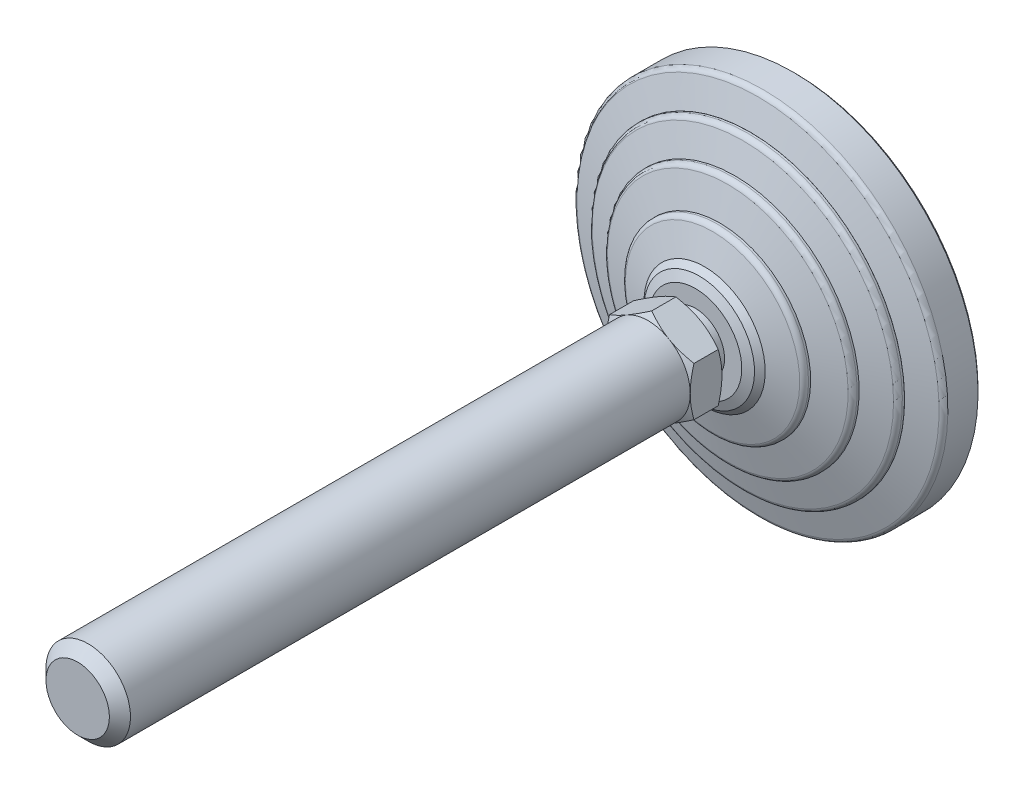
ISO-10303-21;
HEADER;
FILE_DESCRIPTION(('STEP AP214'),'2;1');
FILE_NAME('part.step','',(''),(''),'','','');
FILE_SCHEMA(('AUTOMOTIVE_DESIGN { 1 0 10303 214 1 1 1 1 }'));
ENDSEC;
DATA;
#1=APPLICATION_CONTEXT('core data for automotive mechanical design processes');
#2=APPLICATION_PROTOCOL_DEFINITION('international standard','automotive_design',2000,#1);
#3=PRODUCT_CONTEXT('',#1,'mechanical');
#4=PRODUCT('Part','Part','',(#3));
#5=PRODUCT_RELATED_PRODUCT_CATEGORY('part','',(#4));
#6=PRODUCT_DEFINITION_FORMATION('','',#4);
#7=PRODUCT_DEFINITION_CONTEXT('part definition',#1,'design');
#8=PRODUCT_DEFINITION('design','',#6,#7);
#9=PRODUCT_DEFINITION_SHAPE('','',#8);
#10=(LENGTH_UNIT() NAMED_UNIT(*) SI_UNIT(.MILLI.,.METRE.));
#11=(NAMED_UNIT(*) PLANE_ANGLE_UNIT() SI_UNIT($,.RADIAN.));
#12=(NAMED_UNIT(*) SI_UNIT($,.STERADIAN.) SOLID_ANGLE_UNIT());
#13=UNCERTAINTY_MEASURE_WITH_UNIT(LENGTH_MEASURE(1.E-05),#10,'distance_accuracy_value','');
#14=(GEOMETRIC_REPRESENTATION_CONTEXT(3) GLOBAL_UNCERTAINTY_ASSIGNED_CONTEXT((#13)) GLOBAL_UNIT_ASSIGNED_CONTEXT((#10,
#11,#12)) REPRESENTATION_CONTEXT('',''));
#15=CARTESIAN_POINT('',(0.,0.,0.));
#16=DIRECTION('',(0.,0.,1.));
#17=DIRECTION('',(1.,0.,0.));
#18=AXIS2_PLACEMENT_3D('',#15,#16,#17);
#19=CARTESIAN_POINT('',(-7.76470588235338,0.,21.9999999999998));
#20=DIRECTION('',(0.,0.,1.));
#21=DIRECTION('',(0.,-1.,0.));
#22=AXIS2_PLACEMENT_3D('',#19,#20,#21);
#23=PLANE('',#22);
#24=CARTESIAN_POINT('',(0.,0.,21.9999999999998));
#25=DIRECTION('',(0.,0.,-1.));
#26=DIRECTION('',(0.,1.,0.));
#27=AXIS2_PLACEMENT_3D('',#24,#25,#26);
#28=CIRCLE('',#27,5.50000000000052);
#29=CARTESIAN_POINT('',(0.,5.50000000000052,21.9999999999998));
#30=VERTEX_POINT('',#29);
#31=EDGE_CURVE('E338',#30,#30,#28,.T.);
#32=ORIENTED_EDGE('',*,*,#31,.F.);
#33=EDGE_LOOP('',(#32));
#34=FACE_BOUND('',#33,.T.);
#35=CARTESIAN_POINT('',(0.,0.,21.9999999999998));
#36=DIRECTION('',(0.,0.,-1.));
#37=DIRECTION('',(-1.,0.,0.));
#38=AXIS2_PLACEMENT_3D('',#35,#36,#37);
#39=CIRCLE('',#38,8.00000000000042);
#40=CARTESIAN_POINT('',(4.,6.92820323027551,21.9999999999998));
#41=VERTEX_POINT('',#40);
#42=CARTESIAN_POINT('',(8.,0.,21.9999999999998));
#43=VERTEX_POINT('',#42);
#44=EDGE_CURVE('E491',#41,#43,#39,.T.);
#45=ORIENTED_EDGE('',*,*,#44,.T.);
#46=CARTESIAN_POINT('',(4.,-6.92820323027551,21.9999999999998));
#47=VERTEX_POINT('',#46);
#48=EDGE_CURVE('E140',#43,#47,#39,.T.);
#49=ORIENTED_EDGE('',*,*,#48,.T.);
#50=CARTESIAN_POINT('',(-4.,-6.92820323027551,21.9999999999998));
#51=VERTEX_POINT('',#50);
#52=EDGE_CURVE('E139',#47,#51,#39,.T.);
#53=ORIENTED_EDGE('',*,*,#52,.T.);
#54=CARTESIAN_POINT('',(-8.,0.,21.9999999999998));
#55=VERTEX_POINT('',#54);
#56=EDGE_CURVE('E117',#51,#55,#39,.T.);
#57=ORIENTED_EDGE('',*,*,#56,.T.);
#58=CARTESIAN_POINT('',(-4.,6.92820323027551,21.9999999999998));
#59=VERTEX_POINT('',#58);
#60=EDGE_CURVE('E105',#55,#59,#39,.T.);
#61=ORIENTED_EDGE('',*,*,#60,.T.);
#62=EDGE_CURVE('E34',#59,#41,#39,.T.);
#63=ORIENTED_EDGE('',*,*,#62,.T.);
#64=EDGE_LOOP('',(#45,#49,#53,#57,#61,#63));
#65=FACE_BOUND('',#64,.T.);
#66=ADVANCED_FACE('F14',(#34,#65),#23,.F.);
#67=CARTESIAN_POINT('',(0.,0.,0.));
#68=DIRECTION('',(0.,0.,-1.));
#69=DIRECTION('',(0.,1.,0.));
#70=AXIS2_PLACEMENT_3D('',#67,#68,#69);
#71=CYLINDRICAL_SURFACE('',#70,5.50000000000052);
#72=CARTESIAN_POINT('',(0.,0.,19.));
#73=DIRECTION('',(0.,0.,-1.));
#74=DIRECTION('',(0.,1.,0.));
#75=AXIS2_PLACEMENT_3D('',#72,#73,#74);
#76=CIRCLE('',#75,5.50000000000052);
#77=CARTESIAN_POINT('',(0.,5.50000000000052,19.));
#78=VERTEX_POINT('',#77);
#79=EDGE_CURVE('E343',#78,#78,#76,.T.);
#80=ORIENTED_EDGE('',*,*,#79,.F.);
#81=EDGE_LOOP('',(#80));
#82=FACE_BOUND('',#81,.T.);
#83=ORIENTED_EDGE('',*,*,#31,.T.);
#84=EDGE_LOOP('',(#83));
#85=FACE_BOUND('',#84,.T.);
#86=ADVANCED_FACE('F305',(#82,#85),#71,.T.);
#87=CARTESIAN_POINT('',(-8.7540983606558,0.,19.));
#88=DIRECTION('',(0.,0.,-1.));
#89=DIRECTION('',(0.,1.,0.));
#90=AXIS2_PLACEMENT_3D('',#87,#88,#89);
#91=PLANE('',#90);
#92=CARTESIAN_POINT('',(0.,0.,19.));
#93=DIRECTION('',(0.,0.,-1.));
#94=DIRECTION('',(0.,1.,0.));
#95=AXIS2_PLACEMENT_3D('',#92,#93,#94);
#96=CIRCLE('',#95,8.7540983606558);
#97=CARTESIAN_POINT('',(0.,8.7540983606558,19.));
#98=VERTEX_POINT('',#97);
#99=EDGE_CURVE('E346',#98,#98,#96,.T.);
#100=ORIENTED_EDGE('',*,*,#99,.F.);
#101=EDGE_LOOP('',(#100));
#102=FACE_BOUND('',#101,.T.);
#103=ORIENTED_EDGE('',*,*,#79,.T.);
#104=EDGE_LOOP('',(#103));
#105=FACE_BOUND('',#104,.T.);
#106=ADVANCED_FACE('F301',(#102,#105),#91,.F.);
#107=CARTESIAN_POINT('',(0.,0.,19.));
#108=DIRECTION('',(0.,0.,-1.));
#109=DIRECTION('',(0.,1.,0.));
#110=AXIS2_PLACEMENT_3D('',#107,#108,#109);
#111=CONICAL_SURFACE('',#110,8.7540983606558,1.17809724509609);
#112=CARTESIAN_POINT('',(0.,0.,18.2928932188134));
#113=DIRECTION('',(0.,0.,-1.));
#114=DIRECTION('',(0.,1.,0.));
#115=AXIS2_PLACEMENT_3D('',#112,#113,#114);
#116=CIRCLE('',#115,10.4612051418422);
#117=CARTESIAN_POINT('',(0.,10.4612051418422,18.2928932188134));
#118=VERTEX_POINT('',#117);
#119=EDGE_CURVE('E349',#118,#118,#116,.T.);
#120=ORIENTED_EDGE('',*,*,#119,.F.);
#121=EDGE_LOOP('',(#120));
#122=FACE_BOUND('',#121,.T.);
#123=ORIENTED_EDGE('',*,*,#99,.T.);
#124=EDGE_LOOP('',(#123));
#125=FACE_BOUND('',#124,.T.);
#126=ADVANCED_FACE('F297',(#122,#125),#111,.T.);
#127=CARTESIAN_POINT('',(0.,0.,18.2928932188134));
#128=DIRECTION('',(0.,0.,-1.));
#129=DIRECTION('',(0.,1.,0.));
#130=AXIS2_PLACEMENT_3D('',#127,#128,#129);
#131=CONICAL_SURFACE('',#130,10.4612051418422,0.785398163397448);
#132=CARTESIAN_POINT('',(0.,0.,17.27868852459));
#133=DIRECTION('',(0.,0.,-1.));
#134=DIRECTION('',(0.,1.,0.));
#135=AXIS2_PLACEMENT_3D('',#132,#133,#134);
#136=CIRCLE('',#135,11.4754098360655);
#137=CARTESIAN_POINT('',(0.,11.4754098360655,17.27868852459));
#138=VERTEX_POINT('',#137);
#139=EDGE_CURVE('E352',#138,#138,#136,.T.);
#140=ORIENTED_EDGE('',*,*,#139,.F.);
#141=EDGE_LOOP('',(#140));
#142=FACE_BOUND('',#141,.T.);
#143=ORIENTED_EDGE('',*,*,#119,.T.);
#144=EDGE_LOOP('',(#143));
#145=FACE_BOUND('',#144,.T.);
#146=ADVANCED_FACE('F293',(#142,#145),#131,.T.);
#147=CARTESIAN_POINT('',(0.,0.,17.27868852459));
#148=DIRECTION('',(0.,0.,-1.));
#149=DIRECTION('',(0.,1.,0.));
#150=AXIS2_PLACEMENT_3D('',#147,#148,#149);
#151=CONICAL_SURFACE('',#150,11.4754098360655,1.27933953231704);
#152=CARTESIAN_POINT('',(0.,0.,15.7711726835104));
#153=DIRECTION('',(0.,0.,-1.));
#154=DIRECTION('',(0.,1.,0.));
#155=AXIS2_PLACEMENT_3D('',#152,#153,#154);
#156=CIRCLE('',#155,16.5004626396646);
#157=CARTESIAN_POINT('',(0.,16.5004626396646,15.7711726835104));
#158=VERTEX_POINT('',#157);
#159=EDGE_CURVE('E355',#158,#158,#156,.T.);
#160=ORIENTED_EDGE('',*,*,#159,.F.);
#161=EDGE_LOOP('',(#160));
#162=FACE_BOUND('',#161,.T.);
#163=ORIENTED_EDGE('',*,*,#139,.T.);
#164=EDGE_LOOP('',(#163));
#165=FACE_BOUND('',#164,.T.);
#166=ADVANCED_FACE('F289',(#162,#165),#151,.T.);
#167=CARTESIAN_POINT('',(0.,0.,14.8133463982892));
#168=DIRECTION('',(0.,0.,-1.));
#169=DIRECTION('',(0.,1.,0.));
#170=AXIS2_PLACEMENT_3D('',#167,#168,#169);
#171=TOROIDAL_SURFACE('',#170,16.2131147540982,1.);
#172=CARTESIAN_POINT('',(0.,0.,14.8133463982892));
#173=DIRECTION('',(0.,0.,-1.));
#174=DIRECTION('',(0.,1.,0.));
#175=AXIS2_PLACEMENT_3D('',#172,#173,#174);
#176=CIRCLE('',#175,17.2131147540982);
#177=CARTESIAN_POINT('',(0.,17.2131147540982,14.8133463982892));
#178=VERTEX_POINT('',#177);
#179=EDGE_CURVE('E358',#178,#178,#176,.T.);
#180=ORIENTED_EDGE('',*,*,#179,.F.);
#181=EDGE_LOOP('',(#180));
#182=FACE_BOUND('',#181,.T.);
#183=ORIENTED_EDGE('',*,*,#159,.T.);
#184=EDGE_LOOP('',(#183));
#185=FACE_BOUND('',#184,.T.);
#186=ADVANCED_FACE('F285',(#182,#185),#171,.T.);
#187=CARTESIAN_POINT('',(0.,0.,0.));
#188=DIRECTION('',(0.,0.,-1.));
#189=DIRECTION('',(0.,1.,0.));
#190=AXIS2_PLACEMENT_3D('',#187,#188,#189);
#191=CYLINDRICAL_SURFACE('',#190,17.2131147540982);
#192=CARTESIAN_POINT('',(0.,0.,14.4098360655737));
#193=DIRECTION('',(0.,0.,-1.));
#194=DIRECTION('',(0.,1.,0.));
#195=AXIS2_PLACEMENT_3D('',#192,#193,#194);
#196=CIRCLE('',#195,17.2131147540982);
#197=CARTESIAN_POINT('',(0.,17.2131147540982,14.4098360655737));
#198=VERTEX_POINT('',#197);
#199=EDGE_CURVE('E361',#198,#198,#196,.T.);
#200=ORIENTED_EDGE('',*,*,#199,.F.);
#201=EDGE_LOOP('',(#200));
#202=FACE_BOUND('',#201,.T.);
#203=ORIENTED_EDGE('',*,*,#179,.T.);
#204=EDGE_LOOP('',(#203));
#205=FACE_BOUND('',#204,.T.);
#206=ADVANCED_FACE('F281',(#202,#205),#191,.T.);
#207=CARTESIAN_POINT('',(0.,0.,14.4098360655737));
#208=DIRECTION('',(0.,0.,-1.));
#209=DIRECTION('',(0.,1.,0.));
#210=AXIS2_PLACEMENT_3D('',#207,#208,#209);
#211=CONICAL_SURFACE('',#210,17.2131147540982,1.30454427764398);
#212=CARTESIAN_POINT('',(0.,0.,12.8894925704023));
#213=DIRECTION('',(0.,0.,-1.));
#214=DIRECTION('',(0.,1.,0.));
#215=AXIS2_PLACEMENT_3D('',#212,#213,#214);
#216=CIRCLE('',#215,22.7877075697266);
#217=CARTESIAN_POINT('',(0.,22.7877075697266,12.8894925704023));
#218=VERTEX_POINT('',#217);
#219=EDGE_CURVE('E364',#218,#218,#216,.T.);
#220=ORIENTED_EDGE('',*,*,#219,.F.);
#221=EDGE_LOOP('',(#220));
#222=FACE_BOUND('',#221,.T.);
#223=ORIENTED_EDGE('',*,*,#199,.T.);
#224=EDGE_LOOP('',(#223));
#225=FACE_BOUND('',#224,.T.);
#226=ADVANCED_FACE('F277',(#222,#225),#211,.T.);
#227=CARTESIAN_POINT('',(0.,0.,11.9247287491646));
#228=DIRECTION('',(0.,0.,-1.));
#229=DIRECTION('',(0.,1.,0.));
#230=AXIS2_PLACEMENT_3D('',#227,#228,#229);
#231=TOROIDAL_SURFACE('',#230,22.5245901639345,1.);
#232=CARTESIAN_POINT('',(0.,0.,11.9247287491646));
#233=DIRECTION('',(0.,0.,-1.));
#234=DIRECTION('',(0.,1.,0.));
#235=AXIS2_PLACEMENT_3D('',#232,#233,#234);
#236=CIRCLE('',#235,23.5245901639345);
#237=CARTESIAN_POINT('',(0.,23.5245901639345,11.9247287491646));
#238=VERTEX_POINT('',#237);
#239=EDGE_CURVE('E367',#238,#238,#236,.T.);
#240=ORIENTED_EDGE('',*,*,#239,.F.);
#241=EDGE_LOOP('',(#240));
#242=FACE_BOUND('',#241,.T.);
#243=ORIENTED_EDGE('',*,*,#219,.T.);
#244=EDGE_LOOP('',(#243));
#245=FACE_BOUND('',#244,.T.);
#246=ADVANCED_FACE('F273',(#242,#245),#231,.T.);
#247=CARTESIAN_POINT('',(0.,0.,0.));
#248=DIRECTION('',(0.,0.,-1.));
#249=DIRECTION('',(0.,1.,0.));
#250=AXIS2_PLACEMENT_3D('',#247,#248,#249);
#251=CYLINDRICAL_SURFACE('',#250,23.5245901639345);
#252=CARTESIAN_POINT('',(0.,0.,11.5409836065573));
#253=DIRECTION('',(0.,0.,-1.));
#254=DIRECTION('',(0.,1.,0.));
#255=AXIS2_PLACEMENT_3D('',#252,#253,#254);
#256=CIRCLE('',#255,23.5245901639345);
#257=CARTESIAN_POINT('',(0.,23.5245901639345,11.5409836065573));
#258=VERTEX_POINT('',#257);
#259=EDGE_CURVE('E370',#258,#258,#256,.T.);
#260=ORIENTED_EDGE('',*,*,#259,.F.);
#261=EDGE_LOOP('',(#260));
#262=FACE_BOUND('',#261,.T.);
#263=ORIENTED_EDGE('',*,*,#239,.T.);
#264=EDGE_LOOP('',(#263));
#265=FACE_BOUND('',#264,.T.);
#266=ADVANCED_FACE('F269',(#262,#265),#251,.T.);
#267=CARTESIAN_POINT('',(0.,0.,11.5409836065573));
#268=DIRECTION('',(0.,0.,-1.));
#269=DIRECTION('',(0.,1.,0.));
#270=AXIS2_PLACEMENT_3D('',#267,#268,#269);
#271=CONICAL_SURFACE('',#270,23.5245901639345,1.27871257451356);
#272=CARTESIAN_POINT('',(0.,0.,10.0337743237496));
#273=DIRECTION('',(0.,0.,-1.));
#274=DIRECTION('',(0.,1.,0.));
#275=AXIS2_PLACEMENT_3D('',#272,#273,#274);
#276=CIRCLE('',#275,28.5372004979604);
#277=CARTESIAN_POINT('',(0.,28.5372004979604,10.0337743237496));
#278=VERTEX_POINT('',#277);
#279=EDGE_CURVE('E373',#278,#278,#276,.T.);
#280=ORIENTED_EDGE('',*,*,#279,.F.);
#281=EDGE_LOOP('',(#280));
#282=FACE_BOUND('',#281,.T.);
#283=ORIENTED_EDGE('',*,*,#259,.T.);
#284=EDGE_LOOP('',(#283));
#285=FACE_BOUND('',#284,.T.);
#286=ADVANCED_FACE('F265',(#282,#285),#271,.T.);
#287=CARTESIAN_POINT('',(0.,0.,9.07612838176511));
#288=DIRECTION('',(0.,0.,-1.));
#289=DIRECTION('',(0.,1.,0.));
#290=AXIS2_PLACEMENT_3D('',#287,#288,#289);
#291=TOROIDAL_SURFACE('',#290,28.2492521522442,1.);
#292=CARTESIAN_POINT('',(0.,0.,9.07612838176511));
#293=DIRECTION('',(0.,0.,-1.));
#294=DIRECTION('',(0.,1.,0.));
#295=AXIS2_PLACEMENT_3D('',#292,#293,#294);
#296=CIRCLE('',#295,29.2492521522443);
#297=CARTESIAN_POINT('',(0.,29.2492521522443,9.07612838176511));
#298=VERTEX_POINT('',#297);
#299=EDGE_CURVE('E376',#298,#298,#296,.T.);
#300=ORIENTED_EDGE('',*,*,#299,.F.);
#301=EDGE_LOOP('',(#300));
#302=FACE_BOUND('',#301,.T.);
#303=ORIENTED_EDGE('',*,*,#279,.T.);
#304=EDGE_LOOP('',(#303));
#305=FACE_BOUND('',#304,.T.);
#306=ADVANCED_FACE('F261',(#302,#305),#291,.T.);
#307=CARTESIAN_POINT('',(0.,0.,0.));
#308=DIRECTION('',(0.,0.,-1.));
#309=DIRECTION('',(0.,1.,0.));
#310=AXIS2_PLACEMENT_3D('',#307,#308,#309);
#311=CYLINDRICAL_SURFACE('',#310,29.2492521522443);
#312=CARTESIAN_POINT('',(0.,0.,8.67213114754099));
#313=DIRECTION('',(0.,0.,-1.));
#314=DIRECTION('',(0.,1.,0.));
#315=AXIS2_PLACEMENT_3D('',#312,#313,#314);
#316=CIRCLE('',#315,29.2492521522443);
#317=CARTESIAN_POINT('',(0.,29.2492521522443,8.67213114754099));
#318=VERTEX_POINT('',#317);
#319=EDGE_CURVE('E379',#318,#318,#316,.T.);
#320=ORIENTED_EDGE('',*,*,#319,.F.);
#321=EDGE_LOOP('',(#320));
#322=FACE_BOUND('',#321,.T.);
#323=ORIENTED_EDGE('',*,*,#299,.T.);
#324=EDGE_LOOP('',(#323));
#325=FACE_BOUND('',#324,.T.);
#326=ADVANCED_FACE('F257',(#322,#325),#311,.T.);
#327=CARTESIAN_POINT('',(-29.2622950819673,0.,8.67213114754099));
#328=DIRECTION('',(0.,0.,-1.));
#329=DIRECTION('',(0.,1.,0.));
#330=AXIS2_PLACEMENT_3D('',#327,#328,#329);
#331=PLANE('',#330);
#332=CARTESIAN_POINT('',(0.,0.,8.67213114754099));
#333=DIRECTION('',(0.,0.,-1.));
#334=DIRECTION('',(0.,1.,0.));
#335=AXIS2_PLACEMENT_3D('',#332,#333,#334);
#336=CIRCLE('',#335,29.2622950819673);
#337=CARTESIAN_POINT('',(0.,29.2622950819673,8.67213114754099));
#338=VERTEX_POINT('',#337);
#339=EDGE_CURVE('E382',#338,#338,#336,.T.);
#340=ORIENTED_EDGE('',*,*,#339,.F.);
#341=EDGE_LOOP('',(#340));
#342=FACE_BOUND('',#341,.T.);
#343=ORIENTED_EDGE('',*,*,#319,.T.);
#344=EDGE_LOOP('',(#343));
#345=FACE_BOUND('',#344,.T.);
#346=ADVANCED_FACE('F253',(#342,#345),#331,.F.);
#347=CARTESIAN_POINT('',(0.,0.,8.67213114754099));
#348=DIRECTION('',(0.,0.,-1.));
#349=DIRECTION('',(0.,1.,0.));
#350=AXIS2_PLACEMENT_3D('',#347,#348,#349);
#351=CONICAL_SURFACE('',#350,29.2622950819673,1.27933953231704);
#352=CARTESIAN_POINT('',(0.,0.,7.16461530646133));
#353=DIRECTION('',(0.,0.,-1.));
#354=DIRECTION('',(0.,1.,0.));
#355=AXIS2_PLACEMENT_3D('',#352,#353,#354);
#356=CIRCLE('',#355,34.2873478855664);
#357=CARTESIAN_POINT('',(0.,34.2873478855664,7.16461530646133));
#358=VERTEX_POINT('',#357);
#359=EDGE_CURVE('E385',#358,#358,#356,.T.);
#360=ORIENTED_EDGE('',*,*,#359,.F.);
#361=EDGE_LOOP('',(#360));
#362=FACE_BOUND('',#361,.T.);
#363=ORIENTED_EDGE('',*,*,#339,.T.);
#364=EDGE_LOOP('',(#363));
#365=FACE_BOUND('',#364,.T.);
#366=ADVANCED_FACE('F249',(#362,#365),#351,.T.);
#367=CARTESIAN_POINT('',(0.,0.,6.20678902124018));
#368=DIRECTION('',(0.,0.,-1.));
#369=DIRECTION('',(0.,1.,0.));
#370=AXIS2_PLACEMENT_3D('',#367,#368,#369);
#371=TOROIDAL_SURFACE('',#370,34.,1.);
#372=CARTESIAN_POINT('',(0.,0.,6.20678902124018));
#373=DIRECTION('',(0.,0.,-1.));
#374=DIRECTION('',(0.,1.,0.));
#375=AXIS2_PLACEMENT_3D('',#372,#373,#374);
#376=CIRCLE('',#375,35.);
#377=CARTESIAN_POINT('',(0.,35.,6.20678902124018));
#378=VERTEX_POINT('',#377);
#379=EDGE_CURVE('E388',#378,#378,#376,.T.);
#380=ORIENTED_EDGE('',*,*,#379,.F.);
#381=EDGE_LOOP('',(#380));
#382=FACE_BOUND('',#381,.T.);
#383=ORIENTED_EDGE('',*,*,#359,.T.);
#384=EDGE_LOOP('',(#383));
#385=FACE_BOUND('',#384,.T.);
#386=ADVANCED_FACE('F245',(#382,#385),#371,.T.);
#387=CARTESIAN_POINT('',(0.,0.,0.));
#388=DIRECTION('',(0.,0.,-1.));
#389=DIRECTION('',(0.,1.,0.));
#390=AXIS2_PLACEMENT_3D('',#387,#388,#389);
#391=CYLINDRICAL_SURFACE('',#390,35.);
#392=CARTESIAN_POINT('',(0.,0.,0.5));
#393=DIRECTION('',(0.,0.,-1.));
#394=DIRECTION('',(0.,1.,0.));
#395=AXIS2_PLACEMENT_3D('',#392,#393,#394);
#396=CIRCLE('',#395,35.);
#397=CARTESIAN_POINT('',(0.,35.,0.5));
#398=VERTEX_POINT('',#397);
#399=EDGE_CURVE('E391',#398,#398,#396,.T.);
#400=ORIENTED_EDGE('',*,*,#399,.F.);
#401=EDGE_LOOP('',(#400));
#402=FACE_BOUND('',#401,.T.);
#403=ORIENTED_EDGE('',*,*,#379,.T.);
#404=EDGE_LOOP('',(#403));
#405=FACE_BOUND('',#404,.T.);
#406=ADVANCED_FACE('F241',(#402,#405),#391,.T.);
#407=CARTESIAN_POINT('',(0.,0.,0.5));
#408=DIRECTION('',(0.,0.,1.));
#409=DIRECTION('',(0.,-1.,0.));
#410=AXIS2_PLACEMENT_3D('',#407,#408,#409);
#411=CONICAL_SURFACE('',#410,35.,0.785398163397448);
#412=CARTESIAN_POINT('',(0.,0.,0.));
#413=DIRECTION('',(0.,0.,-1.));
#414=DIRECTION('',(0.,1.,0.));
#415=AXIS2_PLACEMENT_3D('',#412,#413,#414);
#416=CIRCLE('',#415,34.5);
#417=CARTESIAN_POINT('',(0.,34.5,0.));
#418=VERTEX_POINT('',#417);
#419=EDGE_CURVE('E394',#418,#418,#416,.T.);
#420=ORIENTED_EDGE('',*,*,#419,.F.);
#421=EDGE_LOOP('',(#420));
#422=FACE_BOUND('',#421,.T.);
#423=ORIENTED_EDGE('',*,*,#399,.T.);
#424=EDGE_LOOP('',(#423));
#425=FACE_BOUND('',#424,.T.);
#426=ADVANCED_FACE('F237',(#422,#425),#411,.T.);
#427=CARTESIAN_POINT('',(-34.5,0.,0.));
#428=DIRECTION('',(0.,0.,1.));
#429=DIRECTION('',(0.,-1.,0.));
#430=AXIS2_PLACEMENT_3D('',#427,#428,#429);
#431=PLANE('',#430);
#432=ORIENTED_EDGE('',*,*,#419,.T.);
#433=EDGE_LOOP('',(#432));
#434=FACE_BOUND('',#433,.T.);
#435=ADVANCED_FACE('F233',(#434),#431,.F.);
#436=CARTESIAN_POINT('',(0.,0.,23.617126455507));
#437=DIRECTION('',(0.,0.,1.));
#438=DIRECTION('',(1.,0.,0.));
#439=AXIS2_PLACEMENT_3D('',#436,#437,#438);
#440=CONICAL_SURFACE('',#439,10.8009451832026,1.0471975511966);
#441=CARTESIAN_POINT('',(8.,-12.3753795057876,25.8890377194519));
#442=CARTESIAN_POINT('',(8.,-12.026234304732,25.719797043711));
#443=CARTESIAN_POINT('',(8.,-11.6762842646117,25.5521881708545));
#444=CARTESIAN_POINT('',(8.,-10.9743463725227,25.2211524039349));
#445=CARTESIAN_POINT('',(8.,-10.6223582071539,25.0577261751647));
#446=CARTESIAN_POINT('',(8.,-9.91408726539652,24.7351451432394));
#447=CARTESIAN_POINT('',(8.,-9.55779152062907,24.5760187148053));
#448=CARTESIAN_POINT('',(8.,-8.84235533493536,24.2643195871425));
#449=CARTESIAN_POINT('',(8.,-8.48321503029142,24.1117465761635));
#450=CARTESIAN_POINT('',(8.,-7.75003410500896,23.8101616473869));
#451=CARTESIAN_POINT('',(8.,-7.37588282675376,23.6614172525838));
#452=CARTESIAN_POINT('',(8.,-6.62319227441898,23.3752619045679));
#453=CARTESIAN_POINT('',(8.,-6.24465251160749,23.2378522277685));
#454=CARTESIAN_POINT('',(8.,-5.48329692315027,22.9779970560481));
#455=CARTESIAN_POINT('',(8.,-5.10049164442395,22.8555209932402));
#456=CARTESIAN_POINT('',(8.,-4.32940390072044,22.6294821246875));
#457=CARTESIAN_POINT('',(8.,-3.94112321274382,22.5259133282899));
#458=CARTESIAN_POINT('',(8.,-3.16095565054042,22.3432378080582));
#459=CARTESIAN_POINT('',(8.,-2.76910051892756,22.263999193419));
#460=CARTESIAN_POINT('',(8.,-2.17777454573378,22.1668334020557));
#461=CARTESIAN_POINT('',(8.,-1.98006054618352,22.1380588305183));
#462=CARTESIAN_POINT('',(8.,-1.58366048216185,22.0883055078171));
#463=CARTESIAN_POINT('',(8.,-1.38497451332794,22.0673260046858));
#464=CARTESIAN_POINT('',(8.,-0.98947812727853,22.0338422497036));
#465=CARTESIAN_POINT('',(8.,-0.792676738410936,22.0212317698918));
#466=CARTESIAN_POINT('',(8.,-0.398717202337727,22.0043422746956));
#467=CARTESIAN_POINT('',(8.,-0.201559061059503,22.0000631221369));
#468=CARTESIAN_POINT('',(8.,0.192761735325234,21.9999382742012));
#469=CARTESIAN_POINT('',(8.,0.389924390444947,22.0040926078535));
#470=CARTESIAN_POINT('',(8.,0.78390029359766,22.0207337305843));
#471=CARTESIAN_POINT('',(8.,0.980713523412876,22.0332209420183));
#472=CARTESIAN_POINT('',(8.,1.45468025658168,22.0730634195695));
#473=CARTESIAN_POINT('',(8.,1.73150390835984,22.1044259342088));
#474=CARTESIAN_POINT('',(8.,2.28306288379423,22.181917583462));
#475=CARTESIAN_POINT('',(8.,2.55779791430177,22.2280487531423));
#476=CARTESIAN_POINT('',(8.,3.37857583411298,22.3861462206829));
#477=CARTESIAN_POINT('',(8.,3.92087737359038,22.5177866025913));
#478=CARTESIAN_POINT('',(8.,4.73169578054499,22.7456338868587));
#479=CARTESIAN_POINT('',(8.,5.00442952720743,22.8276940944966));
#480=CARTESIAN_POINT('',(8.,5.54724743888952,23.0002319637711));
#481=CARTESIAN_POINT('',(8.,5.81733158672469,23.0907096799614));
#482=CARTESIAN_POINT('',(8.,6.35493704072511,23.27863972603));
#483=CARTESIAN_POINT('',(8.,6.62245918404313,23.3760896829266));
#484=CARTESIAN_POINT('',(8.,7.15529439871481,23.5768281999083));
#485=CARTESIAN_POINT('',(8.,7.42060749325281,23.680116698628));
#486=CARTESIAN_POINT('',(8.,8.03544802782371,23.926029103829));
#487=CARTESIAN_POINT('',(8.,8.3842352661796,24.0705000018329));
#488=CARTESIAN_POINT('',(8.,9.07892914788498,24.366228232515));
#489=CARTESIAN_POINT('',(8.,9.42483562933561,24.5174859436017));
#490=CARTESIAN_POINT('',(8.,10.1142822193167,24.8254575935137));
#491=CARTESIAN_POINT('',(8.,10.4578218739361,24.9821725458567));
#492=CARTESIAN_POINT('',(8.,11.1428677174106,25.2999932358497));
#493=CARTESIAN_POINT('',(8.,11.4843738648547,25.4610990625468));
#494=CARTESIAN_POINT('',(8.,12.1660149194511,25.7870570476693));
#495=CARTESIAN_POINT('',(8.,12.5061480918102,25.9519128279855));
#496=CARTESIAN_POINT('',(8.,13.1849627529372,26.2845891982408));
#497=CARTESIAN_POINT('',(8.,13.5236442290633,26.4524098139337));
#498=CARTESIAN_POINT('',(8.,14.5377665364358,26.9595050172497));
#499=CARTESIAN_POINT('',(8.,15.2113700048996,27.3024538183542));
#500=CARTESIAN_POINT('',(8.,16.5004590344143,27.9671716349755));
#501=CARTESIAN_POINT('',(8.,17.1162243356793,28.2884005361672));
#502=CARTESIAN_POINT('',(8.,18.3454441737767,28.9352947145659));
#503=CARTESIAN_POINT('',(8.,18.9588986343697,29.2609601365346));
#504=CARTESIAN_POINT('',(8.,20.182540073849,29.9149033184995));
#505=CARTESIAN_POINT('',(8.,20.7927313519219,30.243173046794));
#506=CARTESIAN_POINT('',(8.,22.0116293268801,30.9023820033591));
#507=CARTESIAN_POINT('',(8.,22.6203361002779,31.233321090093));
#508=CARTESIAN_POINT('',(8.,23.2284931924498,31.5652604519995));
#509=B_SPLINE_CURVE_WITH_KNOTS('',3,(#441,#442,#443,#444,#445,#446,#447,#448,#449,#450,#451,
#452,#453,#454,#455,#456,#457,#458,#459,#460,#461,#462,#463,#464,#465,#466,#467,#468,#469,#470,
#471,#472,#473,#474,#475,#476,#477,#478,#479,#480,#481,#482,#483,#484,#485,#486,#487,#488,#489,
#490,#491,#492,#493,#494,#495,#496,#497,#498,#499,#500,#501,#502,#503,#504,#505,#506,#507,#508),
.UNSPECIFIED.,.F.,.F.,(4,2,2,2,2,2,2,2,2,2,2,2,2,2,2,2,2,2,2,2,2,2,2,2,2,2,2,2,2,2,2,2,2,4),(0.,
1.16401736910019,2.3282187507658,3.49881138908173,4.66934827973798,5.87710756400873,
7.08500267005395,8.29038225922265,9.49537926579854,10.6937238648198,11.2929850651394,
11.8921884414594,12.4836327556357,13.0750673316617,13.6665039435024,14.257970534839,
15.0932815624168,15.9287077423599,17.6005026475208,18.4548671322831,19.3092371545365,
20.1633177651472,21.0173894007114,22.1498659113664,23.2824056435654,24.4151568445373,
25.5479310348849,26.6818501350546,27.8157790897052,30.083354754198,32.1668886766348,
34.2504907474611,36.3291490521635,38.4076978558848),.UNSPECIFIED.);
#510=CARTESIAN_POINT('',(8.,4.61880215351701,22.7145311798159));
#511=VERTEX_POINT('',#510);
#512=EDGE_CURVE('E115',#511,#43,#509,.F.);
#513=ORIENTED_EDGE('',*,*,#512,.T.);
#514=ORIENTED_EDGE('',*,*,#44,.F.);
#515=CARTESIAN_POINT('',(-0.00019999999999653,9.23771977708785,22.7145978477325));
#516=CARTESIAN_POINT('',(0.1756487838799,9.13619343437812,22.6559907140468));
#517=CARTESIAN_POINT('',(0.352153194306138,9.03428856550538,22.6000434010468));
#518=CARTESIAN_POINT('',(0.706595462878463,8.82965122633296,22.4942010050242));
#519=CARTESIAN_POINT('',(0.884533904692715,8.72691841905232,22.4443085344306));
#520=CARTESIAN_POINT('',(1.42119823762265,8.41707512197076,22.3046927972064));
#521=CARTESIAN_POINT('',(1.78204258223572,8.20874154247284,22.2252811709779));
#522=CARTESIAN_POINT('',(2.32203917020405,7.89697436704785,22.132161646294));
#523=CARTESIAN_POINT('',(2.49957818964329,7.79447216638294,22.1056345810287));
#524=CARTESIAN_POINT('',(2.8554591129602,7.58900421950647,22.0611531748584));
#525=CARTESIAN_POINT('',(3.03380094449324,7.4860385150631,22.0431980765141));
#526=CARTESIAN_POINT('',(3.3907916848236,7.27992981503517,22.0163156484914));
#527=CARTESIAN_POINT('',(3.5694400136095,7.17678715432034,22.0073780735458));
#528=CARTESIAN_POINT('',(3.92690170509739,6.97040655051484,21.9987223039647));
#529=CARTESIAN_POINT('',(4.10571506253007,6.86716861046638,21.9990038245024));
#530=CARTESIAN_POINT('',(4.44001336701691,6.67416139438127,22.0081450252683));
#531=CARTESIAN_POINT('',(4.59552190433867,6.58437849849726,22.0158896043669));
#532=CARTESIAN_POINT('',(4.90617476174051,6.40502298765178,22.0382011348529));
#533=CARTESIAN_POINT('',(5.06131905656,6.31545038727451,22.0527685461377));
#534=CARTESIAN_POINT('',(5.52615131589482,6.04707935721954,22.1063606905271));
#535=CARTESIAN_POINT('',(5.83501648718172,5.86875596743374,22.1552686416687));
#536=CARTESIAN_POINT('',(6.4560232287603,5.51021755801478,22.2775394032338));
#537=CARTESIAN_POINT('',(6.76808554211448,5.33004829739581,22.3514205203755));
#538=CARTESIAN_POINT('',(7.38755648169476,4.97239658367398,22.5191001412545));
#539=CARTESIAN_POINT('',(7.69497304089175,4.79490955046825,22.612859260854));
#540=CARTESIAN_POINT('',(8.0002,4.61868668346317,22.7145978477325));
#541=B_SPLINE_CURVE_WITH_KNOTS('',3,(#515,#516,#517,#518,#519,#520,#521,#522,#523,#524,#525,
#526,#527,#528,#529,#530,#531,#532,#533,#534,#535,#536,#537,#538,#539,#540),.UNSPECIFIED.,.F.,
.F.,(4,2,2,2,2,2,2,2,2,2,2,2,4),(0.,0.63397354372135,1.26821965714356,2.53934712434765,
3.15934343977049,3.77928496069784,4.39852133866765,5.01773858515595,5.55680239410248,
6.09590254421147,7.17487077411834,8.27776850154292,9.37850115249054),.UNSPECIFIED.);
#542=EDGE_CURVE('E18',#41,#511,#541,.T.);
#543=ORIENTED_EDGE('',*,*,#542,.T.);
#544=EDGE_LOOP('',(#513,#514,#543));
#545=FACE_BOUND('',#544,.T.);
#546=ADVANCED_FACE('F157',(#545),#440,.T.);
#547=CARTESIAN_POINT('',(-8.0002,4.61868668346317,22.7145978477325));
#548=CARTESIAN_POINT('',(-7.8243512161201,4.7202130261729,22.6559907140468));
#549=CARTESIAN_POINT('',(-7.64784680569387,4.82211789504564,22.6000434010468));
#550=CARTESIAN_POINT('',(-7.29340453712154,5.02675523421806,22.4942010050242));
#551=CARTESIAN_POINT('',(-7.11546609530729,5.1294880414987,22.4443085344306));
#552=CARTESIAN_POINT('',(-6.57880176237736,5.43933133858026,22.3046927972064));
#553=CARTESIAN_POINT('',(-6.21795741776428,5.64766491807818,22.2252811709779));
#554=CARTESIAN_POINT('',(-5.67796082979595,5.95943209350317,22.132161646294));
#555=CARTESIAN_POINT('',(-5.50042181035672,6.06193429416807,22.1056345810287));
#556=CARTESIAN_POINT('',(-5.1445408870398,6.26740224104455,22.0611531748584));
#557=CARTESIAN_POINT('',(-4.96619905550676,6.37036794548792,22.0431980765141));
#558=CARTESIAN_POINT('',(-4.60920831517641,6.57647664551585,22.0163156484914));
#559=CARTESIAN_POINT('',(-4.4305599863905,6.67961930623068,22.0073780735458));
#560=CARTESIAN_POINT('',(-4.07309829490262,6.88599991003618,21.9987223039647));
#561=CARTESIAN_POINT('',(-3.89428493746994,6.98923785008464,21.9990038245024));
#562=CARTESIAN_POINT('',(-3.5599866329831,7.18224506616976,22.0081450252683));
#563=CARTESIAN_POINT('',(-3.40447809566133,7.27202796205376,22.0158896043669));
#564=CARTESIAN_POINT('',(-3.09382523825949,7.45138347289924,22.0382011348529));
#565=CARTESIAN_POINT('',(-2.93868094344,7.54095607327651,22.0527685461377));
#566=CARTESIAN_POINT('',(-2.47384868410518,7.80932710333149,22.1063606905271));
#567=CARTESIAN_POINT('',(-2.16498351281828,7.98765049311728,22.1552686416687));
#568=CARTESIAN_POINT('',(-1.5439767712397,8.34618890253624,22.2775394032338));
#569=CARTESIAN_POINT('',(-1.23191445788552,8.52635816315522,22.3514205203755));
#570=CARTESIAN_POINT('',(-0.612443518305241,8.88400987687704,22.5191001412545));
#571=CARTESIAN_POINT('',(-0.305026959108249,9.06149691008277,22.612859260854));
#572=CARTESIAN_POINT('',(0.000200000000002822,9.23771977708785,22.7145978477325));
#573=B_SPLINE_CURVE_WITH_KNOTS('',3,(#547,#548,#549,#550,#551,#552,#553,#554,#555,#556,#557,
#558,#559,#560,#561,#562,#563,#564,#565,#566,#567,#568,#569,#570,#571,#572),.UNSPECIFIED.,.F.,
.F.,(4,2,2,2,2,2,2,2,2,2,2,2,4),(0.,0.63397354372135,1.26821965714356,2.53934712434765,
3.15934343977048,3.77928496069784,4.39852133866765,5.01773858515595,5.55680239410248,
6.09590254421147,7.17487077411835,8.27776850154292,9.37850115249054),.UNSPECIFIED.);
#574=CARTESIAN_POINT('',(0.,9.23760430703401,22.7145311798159));
#575=VERTEX_POINT('',#574);
#576=EDGE_CURVE('E149',#59,#575,#573,.T.);
#577=ORIENTED_EDGE('',*,*,#576,.T.);
#578=EDGE_CURVE('E9',#575,#41,#541,.T.);
#579=ORIENTED_EDGE('',*,*,#578,.T.);
#580=ORIENTED_EDGE('',*,*,#62,.F.);
#581=EDGE_LOOP('',(#577,#579,#580));
#582=FACE_BOUND('',#581,.T.);
#583=ADVANCED_FACE('F484',(#582),#440,.T.);
#584=CARTESIAN_POINT('',(8.0002,-4.61868668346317,22.7145978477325));
#585=CARTESIAN_POINT('',(7.8243512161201,-4.7202130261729,22.6559907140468));
#586=CARTESIAN_POINT('',(7.64784680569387,-4.82211789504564,22.6000434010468));
#587=CARTESIAN_POINT('',(7.29340453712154,-5.02675523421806,22.4942010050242));
#588=CARTESIAN_POINT('',(7.11546609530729,-5.1294880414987,22.4443085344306));
#589=CARTESIAN_POINT('',(6.57880176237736,-5.43933133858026,22.3046927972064));
#590=CARTESIAN_POINT('',(6.21795741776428,-5.64766491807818,22.2252811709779));
#591=CARTESIAN_POINT('',(5.67796082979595,-5.95943209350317,22.132161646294));
#592=CARTESIAN_POINT('',(5.50042181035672,-6.06193429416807,22.1056345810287));
#593=CARTESIAN_POINT('',(5.1445408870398,-6.26740224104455,22.0611531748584));
#594=CARTESIAN_POINT('',(4.96619905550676,-6.37036794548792,22.0431980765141));
#595=CARTESIAN_POINT('',(4.60920831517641,-6.57647664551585,22.0163156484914));
#596=CARTESIAN_POINT('',(4.4305599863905,-6.67961930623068,22.0073780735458));
#597=CARTESIAN_POINT('',(4.07309829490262,-6.88599991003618,21.9987223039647));
#598=CARTESIAN_POINT('',(3.89428493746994,-6.98923785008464,21.9990038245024));
#599=CARTESIAN_POINT('',(3.5599866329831,-7.18224506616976,22.0081450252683));
#600=CARTESIAN_POINT('',(3.40447809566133,-7.27202796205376,22.0158896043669));
#601=CARTESIAN_POINT('',(3.09382523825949,-7.45138347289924,22.0382011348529));
#602=CARTESIAN_POINT('',(2.93868094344,-7.54095607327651,22.0527685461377));
#603=CARTESIAN_POINT('',(2.47384868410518,-7.80932710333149,22.1063606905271));
#604=CARTESIAN_POINT('',(2.16498351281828,-7.98765049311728,22.1552686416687));
#605=CARTESIAN_POINT('',(1.5439767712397,-8.34618890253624,22.2775394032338));
#606=CARTESIAN_POINT('',(1.23191445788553,-8.52635816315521,22.3514205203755));
#607=CARTESIAN_POINT('',(0.612443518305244,-8.88400987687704,22.5191001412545));
#608=CARTESIAN_POINT('',(0.305026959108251,-9.06149691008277,22.612859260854));
#609=CARTESIAN_POINT('',(-0.000199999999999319,-9.23771977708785,22.7145978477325));
#610=B_SPLINE_CURVE_WITH_KNOTS('',3,(#584,#585,#586,#587,#588,#589,#590,#591,#592,#593,#594,
#595,#596,#597,#598,#599,#600,#601,#602,#603,#604,#605,#606,#607,#608,#609),.UNSPECIFIED.,.F.,
.F.,(4,2,2,2,2,2,2,2,2,2,2,2,4),(0.,0.63397354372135,1.26821965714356,2.53934712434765,
3.15934343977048,3.77928496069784,4.39852133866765,5.01773858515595,5.55680239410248,
6.09590254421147,7.17487077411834,8.27776850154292,9.37850115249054),.UNSPECIFIED.);
#611=CARTESIAN_POINT('',(8.,-4.61880215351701,22.7145311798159));
#612=VERTEX_POINT('',#611);
#613=EDGE_CURVE('E135',#612,#47,#610,.T.);
#614=ORIENTED_EDGE('',*,*,#613,.T.);
#615=ORIENTED_EDGE('',*,*,#48,.F.);
#616=EDGE_CURVE('E150',#43,#612,#509,.F.);
#617=ORIENTED_EDGE('',*,*,#616,.T.);
#618=EDGE_LOOP('',(#614,#615,#617));
#619=FACE_BOUND('',#618,.T.);
#620=ADVANCED_FACE('F478',(#619),#440,.T.);
#621=CARTESIAN_POINT('',(0.000200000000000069,-9.23771977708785,22.7145978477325));
#622=CARTESIAN_POINT('',(-0.175648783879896,-9.13619343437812,22.6559907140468));
#623=CARTESIAN_POINT('',(-0.352153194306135,-9.03428856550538,22.6000434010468));
#624=CARTESIAN_POINT('',(-0.70659546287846,-8.82965122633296,22.4942010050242));
#625=CARTESIAN_POINT('',(-0.884533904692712,-8.72691841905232,22.4443085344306));
#626=CARTESIAN_POINT('',(-1.42119823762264,-8.41707512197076,22.3046927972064));
#627=CARTESIAN_POINT('',(-1.78204258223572,-8.20874154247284,22.2252811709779));
#628=CARTESIAN_POINT('',(-2.32203917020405,-7.89697436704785,22.132161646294));
#629=CARTESIAN_POINT('',(-2.49957818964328,-7.79447216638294,22.1056345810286));
#630=CARTESIAN_POINT('',(-2.8554591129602,-7.58900421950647,22.0611531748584));
#631=CARTESIAN_POINT('',(-3.03380094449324,-7.4860385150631,22.0431980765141));
#632=CARTESIAN_POINT('',(-3.39079168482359,-7.27992981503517,22.0163156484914));
#633=CARTESIAN_POINT('',(-3.5694400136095,-7.17678715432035,22.0073780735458));
#634=CARTESIAN_POINT('',(-3.92690170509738,-6.97040655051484,21.9987223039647));
#635=CARTESIAN_POINT('',(-4.10571506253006,-6.86716861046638,21.9990038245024));
#636=CARTESIAN_POINT('',(-4.4400133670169,-6.67416139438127,22.0081450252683));
#637=CARTESIAN_POINT('',(-4.59552190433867,-6.58437849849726,22.0158896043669));
#638=CARTESIAN_POINT('',(-4.90617476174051,-6.40502298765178,22.0382011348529));
#639=CARTESIAN_POINT('',(-5.06131905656,-6.31545038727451,22.0527685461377));
#640=CARTESIAN_POINT('',(-5.52615131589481,-6.04707935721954,22.1063606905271));
#641=CARTESIAN_POINT('',(-5.83501648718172,-5.86875596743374,22.1552686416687));
#642=CARTESIAN_POINT('',(-6.4560232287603,-5.51021755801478,22.2775394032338));
#643=CARTESIAN_POINT('',(-6.76808554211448,-5.33004829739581,22.3514205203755));
#644=CARTESIAN_POINT('',(-7.38755648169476,-4.97239658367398,22.5191001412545));
#645=CARTESIAN_POINT('',(-7.69497304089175,-4.79490955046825,22.612859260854));
#646=CARTESIAN_POINT('',(-8.0002,-4.61868668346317,22.7145978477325));
#647=B_SPLINE_CURVE_WITH_KNOTS('',3,(#621,#622,#623,#624,#625,#626,#627,#628,#629,#630,#631,
#632,#633,#634,#635,#636,#637,#638,#639,#640,#641,#642,#643,#644,#645,#646),.UNSPECIFIED.,.F.,
.F.,(4,2,2,2,2,2,2,2,2,2,2,2,4),(0.,0.633973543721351,1.26821965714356,2.53934712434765,
3.15934343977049,3.77928496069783,4.39852133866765,5.01773858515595,5.55680239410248,
6.09590254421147,7.17487077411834,8.27776850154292,9.37850115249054),.UNSPECIFIED.);
#648=CARTESIAN_POINT('',(0.,-9.23760430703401,22.7145311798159));
#649=VERTEX_POINT('',#648);
#650=EDGE_CURVE('E429',#649,#51,#647,.T.);
#651=ORIENTED_EDGE('',*,*,#650,.T.);
#652=ORIENTED_EDGE('',*,*,#52,.F.);
#653=EDGE_CURVE('E128',#47,#649,#610,.T.);
#654=ORIENTED_EDGE('',*,*,#653,.T.);
#655=EDGE_LOOP('',(#651,#652,#654));
#656=FACE_BOUND('',#655,.T.);
#657=ADVANCED_FACE('F472',(#656),#440,.T.);
#658=CARTESIAN_POINT('',(-8.,-4.618802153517,22.7145311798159));
#659=VERTEX_POINT('',#658);
#660=EDGE_CURVE('E124',#51,#659,#647,.T.);
#661=ORIENTED_EDGE('',*,*,#660,.T.);
#662=CARTESIAN_POINT('',(-8.,-12.3753795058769,25.8890377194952));
#663=CARTESIAN_POINT('',(-8.,-12.0262343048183,25.7197970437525));
#664=CARTESIAN_POINT('',(-8.,-11.676284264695,25.5521881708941));
#665=CARTESIAN_POINT('',(-8.,-10.9743463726,25.221152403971));
#666=CARTESIAN_POINT('',(-8.,-10.6223582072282,25.0577261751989));
#667=CARTESIAN_POINT('',(-8.,-9.91408726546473,24.73514514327));
#668=CARTESIAN_POINT('',(-8.,-9.55779152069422,24.5760187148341));
#669=CARTESIAN_POINT('',(-8.,-8.84235533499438,24.2643195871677));
#670=CARTESIAN_POINT('',(-8.,-8.48321503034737,24.111746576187));
#671=CARTESIAN_POINT('',(-8.,-7.75003410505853,23.8101616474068));
#672=CARTESIAN_POINT('',(-8.,-7.37588282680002,23.6614172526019));
#673=CARTESIAN_POINT('',(-8.,-6.62319227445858,23.3752619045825));
#674=CARTESIAN_POINT('',(-8.,-6.24465251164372,23.2378522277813));
#675=CARTESIAN_POINT('',(-8.,-5.48329692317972,22.9779970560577));
#676=CARTESIAN_POINT('',(-8.,-5.10049164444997,22.8555209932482));
#677=CARTESIAN_POINT('',(-8.,-4.32940390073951,22.6294821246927));
#678=CARTESIAN_POINT('',(-8.,-3.94112321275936,22.5259133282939));
#679=CARTESIAN_POINT('',(-8.,-3.16095565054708,22.3432378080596));
#680=CARTESIAN_POINT('',(-8.,-2.76910051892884,22.2639991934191));
#681=CARTESIAN_POINT('',(-8.,-2.17777454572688,22.1668334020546));
#682=CARTESIAN_POINT('',(-8.,-1.98006054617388,22.1380588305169));
#683=CARTESIAN_POINT('',(-8.,-1.58366048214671,22.0883055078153));
#684=CARTESIAN_POINT('',(-8.,-1.38497451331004,22.067326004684));
#685=CARTESIAN_POINT('',(-8.,-0.989478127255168,22.0338422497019));
#686=CARTESIAN_POINT('',(-8.,-0.79267673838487,22.0212317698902));
#687=CARTESIAN_POINT('',(-8.,-0.398717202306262,22.0043422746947));
#688=CARTESIAN_POINT('',(-8.,-0.201559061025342,22.0000631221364));
#689=CARTESIAN_POINT('',(-8.,0.192761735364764,21.9999382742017));
#690=CARTESIAN_POINT('',(-8.,0.389924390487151,22.0040926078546));
#691=CARTESIAN_POINT('',(-8.,0.783900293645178,22.0207337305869));
#692=CARTESIAN_POINT('',(-8.,0.980713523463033,22.0332209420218));
#693=CARTESIAN_POINT('',(-8.,1.45468025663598,22.073063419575));
#694=CARTESIAN_POINT('',(-8.,1.73150390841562,22.1044259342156));
#695=CARTESIAN_POINT('',(-8.,2.28306288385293,22.1819175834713));
#696=CARTESIAN_POINT('',(-8.,2.5577979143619,22.2280487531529));
#697=CARTESIAN_POINT('',(-8.,3.37857583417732,22.3861462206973));
#698=CARTESIAN_POINT('',(-8.,3.92087737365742,22.5177866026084));
#699=CARTESIAN_POINT('',(-8.,4.73169578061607,22.7456338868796));
#700=CARTESIAN_POINT('',(-8.,5.00442952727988,22.8276940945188));
#701=CARTESIAN_POINT('',(-8.,5.54724743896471,23.0002319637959));
#702=CARTESIAN_POINT('',(-8.,5.81733158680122,23.0907096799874));
#703=CARTESIAN_POINT('',(-8.,6.35493704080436,23.2786397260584));
#704=CARTESIAN_POINT('',(-8.,6.62245918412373,23.3760896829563));
#705=CARTESIAN_POINT('',(-8.,7.15529439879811,23.5768281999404));
#706=CARTESIAN_POINT('',(-8.,7.42060749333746,23.6801166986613));
#707=CARTESIAN_POINT('',(-8.,8.03544802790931,23.926029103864));
#708=CARTESIAN_POINT('',(-8.,8.38423526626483,24.0705000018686));
#709=CARTESIAN_POINT('',(-8.,9.07892914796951,24.3662282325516));
#710=CARTESIAN_POINT('',(-8.,9.42483562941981,24.5174859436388));
#711=CARTESIAN_POINT('',(-8.,10.1142822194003,24.8254575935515));
#712=CARTESIAN_POINT('',(-8.,10.4578218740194,24.982172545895));
#713=CARTESIAN_POINT('',(-8.,11.1428677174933,25.2999932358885));
#714=CARTESIAN_POINT('',(-8.,11.4843738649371,25.4610990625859));
#715=CARTESIAN_POINT('',(-8.,12.166014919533,25.7870570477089));
#716=CARTESIAN_POINT('',(-8.,12.5061480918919,25.9519128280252));
#717=CARTESIAN_POINT('',(-8.,13.1849627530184,26.2845891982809));
#718=CARTESIAN_POINT('',(-8.,13.5236442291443,26.4524098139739));
#719=CARTESIAN_POINT('',(-8.,14.5377665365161,26.9595050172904));
#720=CARTESIAN_POINT('',(-8.,15.2113700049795,27.302453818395));
#721=CARTESIAN_POINT('',(-8.,16.5004590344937,27.9671716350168));
#722=CARTESIAN_POINT('',(-8.,17.1162243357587,28.2884005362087));
#723=CARTESIAN_POINT('',(-8.,18.345444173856,28.9352947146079));
#724=CARTESIAN_POINT('',(-7.99999999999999,18.9588986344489,29.2609601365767));
#725=CARTESIAN_POINT('',(-7.99999999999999,20.1825400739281,29.914903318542));
#726=CARTESIAN_POINT('',(-7.99999999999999,20.792731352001,30.2431730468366));
#727=CARTESIAN_POINT('',(-7.99999999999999,22.0116293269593,30.9023820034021));
#728=CARTESIAN_POINT('',(-8.,22.6203361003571,31.2333210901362));
#729=CARTESIAN_POINT('',(-8.,23.2284931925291,31.5652604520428));
#730=B_SPLINE_CURVE_WITH_KNOTS('',3,(#662,#663,#664,#665,#666,#667,#668,#669,#670,#671,#672,
#673,#674,#675,#676,#677,#678,#679,#680,#681,#682,#683,#684,#685,#686,#687,#688,#689,#690,#691,
#692,#693,#694,#695,#696,#697,#698,#699,#700,#701,#702,#703,#704,#705,#706,#707,#708,#709,#710,
#711,#712,#713,#714,#715,#716,#717,#718,#719,#720,#721,#722,#723,#724,#725,#726,#727,#728,#729),
.UNSPECIFIED.,.F.,.F.,(4,2,2,2,2,2,2,2,2,2,2,2,2,2,2,2,2,2,2,2,2,2,2,2,2,2,2,2,2,2,2,2,2,4),(0.,
1.16401736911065,2.32821875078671,3.49881138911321,4.66934827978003,5.87710756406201,
7.08500267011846,8.29038225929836,9.49537926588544,10.6937238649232,11.2929850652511,
11.8921884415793,12.4836327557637,13.0750673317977,13.6665039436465,14.2579705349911,
15.0932815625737,15.9287077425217,17.6005026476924,18.4548671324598,19.3092371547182,
20.1633177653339,21.0173894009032,22.1498659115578,23.2824056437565,24.415156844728,
25.5479310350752,26.6818501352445,27.8157790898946,30.0833547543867,32.1668886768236,
34.25049074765,36.3291490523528,38.4076978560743),.UNSPECIFIED.);
#731=EDGE_CURVE('E120',#659,#55,#730,.T.);
#732=ORIENTED_EDGE('',*,*,#731,.T.);
#733=ORIENTED_EDGE('',*,*,#56,.F.);
#734=EDGE_LOOP('',(#661,#732,#733));
#735=FACE_BOUND('',#734,.T.);
#736=ADVANCED_FACE('F121',(#735),#440,.T.);
#737=CARTESIAN_POINT('',(-8.,4.61880215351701,22.7145311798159));
#738=VERTEX_POINT('',#737);
#739=EDGE_CURVE('E109',#55,#738,#730,.T.);
#740=ORIENTED_EDGE('',*,*,#739,.T.);
#741=EDGE_CURVE('E111',#738,#59,#573,.T.);
#742=ORIENTED_EDGE('',*,*,#741,.T.);
#743=ORIENTED_EDGE('',*,*,#60,.F.);
#744=EDGE_LOOP('',(#740,#742,#743));
#745=FACE_BOUND('',#744,.T.);
#746=ADVANCED_FACE('F107',(#745),#440,.T.);
#747=CARTESIAN_POINT('',(-6.00000000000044,0.,136.));
#748=DIRECTION('',(0.,0.,-1.));
#749=DIRECTION('',(0.,1.,0.));
#750=AXIS2_PLACEMENT_3D('',#747,#748,#749);
#751=PLANE('',#750);
#752=CARTESIAN_POINT('',(0.,0.,136.));
#753=DIRECTION('',(0.,0.,-1.));
#754=DIRECTION('',(0.,1.,0.));
#755=AXIS2_PLACEMENT_3D('',#752,#753,#754);
#756=CIRCLE('',#755,6.00000000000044);
#757=CARTESIAN_POINT('',(0.,6.00000000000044,136.));
#758=VERTEX_POINT('',#757);
#759=EDGE_CURVE('E332',#758,#758,#756,.T.);
#760=ORIENTED_EDGE('',*,*,#759,.F.);
#761=EDGE_LOOP('',(#760));
#762=FACE_BOUND('',#761,.T.);
#763=ADVANCED_FACE('F16',(#762),#751,.F.);
#764=CARTESIAN_POINT('',(0.,0.,136.));
#765=DIRECTION('',(0.,0.,-1.));
#766=DIRECTION('',(0.,1.,0.));
#767=AXIS2_PLACEMENT_3D('',#764,#765,#766);
#768=CONICAL_SURFACE('',#767,6.00000000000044,0.785398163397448);
#769=CARTESIAN_POINT('',(0.,0.,134.));
#770=DIRECTION('',(0.,0.,-1.));
#771=DIRECTION('',(0.,1.,0.));
#772=AXIS2_PLACEMENT_3D('',#769,#770,#771);
#773=CIRCLE('',#772,8.00000000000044);
#774=CARTESIAN_POINT('',(0.,8.00000000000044,134.));
#775=VERTEX_POINT('',#774);
#776=EDGE_CURVE('E329',#775,#775,#773,.T.);
#777=ORIENTED_EDGE('',*,*,#776,.F.);
#778=EDGE_LOOP('',(#777));
#779=FACE_BOUND('',#778,.T.);
#780=ORIENTED_EDGE('',*,*,#759,.T.);
#781=EDGE_LOOP('',(#780));
#782=FACE_BOUND('',#781,.T.);
#783=ADVANCED_FACE('F316',(#779,#782),#768,.T.);
#784=CARTESIAN_POINT('',(0.,0.,0.));
#785=DIRECTION('',(0.,0.,-1.));
#786=DIRECTION('',(0.,1.,0.));
#787=AXIS2_PLACEMENT_3D('',#784,#785,#786);
#788=CYLINDRICAL_SURFACE('',#787,8.00000000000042);
#789=ORIENTED_EDGE('',*,*,#776,.T.);
#790=EDGE_LOOP('',(#789));
#791=FACE_BOUND('',#790,.T.);
#792=CARTESIAN_POINT('',(0.,0.,28.));
#793=DIRECTION('',(0.,0.,-1.));
#794=DIRECTION('',(0.,1.,0.));
#795=AXIS2_PLACEMENT_3D('',#792,#793,#794);
#796=CIRCLE('',#795,8.00000000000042);
#797=CARTESIAN_POINT('',(4.,6.92820323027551,28.));
#798=VERTEX_POINT('',#797);
#799=CARTESIAN_POINT('',(8.00000000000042,0.,28.));
#800=VERTEX_POINT('',#799);
#801=EDGE_CURVE('E337',#798,#800,#796,.T.);
#802=ORIENTED_EDGE('',*,*,#801,.F.);
#803=CARTESIAN_POINT('',(-4.00000000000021,6.92820323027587,28.));
#804=VERTEX_POINT('',#803);
#805=EDGE_CURVE('E333',#804,#798,#796,.T.);
#806=ORIENTED_EDGE('',*,*,#805,.F.);
#807=CARTESIAN_POINT('',(0.,0.,28.));
#808=DIRECTION('',(0.,0.,-1.));
#809=DIRECTION('',(-1.,0.,0.));
#810=AXIS2_PLACEMENT_3D('',#807,#808,#809);
#811=CIRCLE('',#810,8.00000000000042);
#812=CARTESIAN_POINT('',(-8.00000000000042,0.,28.));
#813=VERTEX_POINT('',#812);
#814=EDGE_CURVE('E426',#813,#804,#811,.T.);
#815=ORIENTED_EDGE('',*,*,#814,.F.);
#816=CARTESIAN_POINT('',(-4.00000000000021,-6.92820323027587,28.));
#817=VERTEX_POINT('',#816);
#818=EDGE_CURVE('E336',#817,#813,#796,.T.);
#819=ORIENTED_EDGE('',*,*,#818,.F.);
#820=CARTESIAN_POINT('',(4.00000000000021,-6.92820323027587,28.));
#821=VERTEX_POINT('',#820);
#822=EDGE_CURVE('E423',#821,#817,#796,.T.);
#823=ORIENTED_EDGE('',*,*,#822,.F.);
#824=EDGE_CURVE('E500',#800,#821,#796,.T.);
#825=ORIENTED_EDGE('',*,*,#824,.F.);
#826=EDGE_LOOP('',(#802,#806,#815,#819,#823,#825));
#827=FACE_BOUND('',#826,.T.);
#828=ADVANCED_FACE('F313',(#791,#827),#788,.T.);
#829=CARTESIAN_POINT('',(0.,0.,28.));
#830=DIRECTION('',(0.,0.,-1.));
#831=DIRECTION('',(-1.,0.,0.));
#832=AXIS2_PLACEMENT_3D('',#829,#830,#831);
#833=CONICAL_SURFACE('',#832,8.00000000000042,1.0471975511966);
#834=CARTESIAN_POINT('',(0.000200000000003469,9.23771977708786,27.2854021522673));
#835=CARTESIAN_POINT('',(-0.175648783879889,9.13619343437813,27.3440092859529));
#836=CARTESIAN_POINT('',(-0.352153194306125,9.03428856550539,27.3999565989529));
#837=CARTESIAN_POINT('',(-0.706595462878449,8.82965122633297,27.5057989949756));
#838=CARTESIAN_POINT('',(-0.884533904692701,8.72691841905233,27.5556914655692));
#839=CARTESIAN_POINT('',(-1.42119823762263,8.41707512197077,27.6953072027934));
#840=CARTESIAN_POINT('',(-1.78204258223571,8.20874154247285,27.7747188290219));
#841=CARTESIAN_POINT('',(-2.32203917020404,7.89697436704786,27.8678383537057));
#842=CARTESIAN_POINT('',(-2.49957818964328,7.79447216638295,27.8943654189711));
#843=CARTESIAN_POINT('',(-2.85545911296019,7.58900421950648,27.9388468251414));
#844=CARTESIAN_POINT('',(-3.03380094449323,7.48603851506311,27.9568019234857));
#845=CARTESIAN_POINT('',(-3.39079168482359,7.27992981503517,27.9836843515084));
#846=CARTESIAN_POINT('',(-3.56944001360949,7.17678715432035,27.992621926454));
#847=CARTESIAN_POINT('',(-3.92690170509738,6.97040655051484,28.0012776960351));
#848=CARTESIAN_POINT('',(-4.10571506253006,6.86716861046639,28.0009961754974));
#849=CARTESIAN_POINT('',(-4.4400133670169,6.67416139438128,27.9918549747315));
#850=CARTESIAN_POINT('',(-4.59552190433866,6.58437849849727,27.9841103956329));
#851=CARTESIAN_POINT('',(-4.9061747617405,6.40502298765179,27.9617988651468));
#852=CARTESIAN_POINT('',(-5.06131905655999,6.31545038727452,27.9472314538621));
#853=CARTESIAN_POINT('',(-5.52615131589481,6.04707935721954,27.8936393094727));
#854=CARTESIAN_POINT('',(-5.83501648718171,5.86875596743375,27.8447313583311));
#855=CARTESIAN_POINT('',(-6.45602322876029,5.51021755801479,27.7224605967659));
#856=CARTESIAN_POINT('',(-6.76808554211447,5.33004829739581,27.6485794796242));
#857=CARTESIAN_POINT('',(-7.38755648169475,4.97239658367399,27.4808998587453));
#858=CARTESIAN_POINT('',(-7.69497304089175,4.79490955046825,27.3871407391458));
#859=CARTESIAN_POINT('',(-8.0002,4.61868668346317,27.2854021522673));
#860=B_SPLINE_CURVE_WITH_KNOTS('',3,(#834,#835,#836,#837,#838,#839,#840,#841,#842,#843,#844,
#845,#846,#847,#848,#849,#850,#851,#852,#853,#854,#855,#856,#857,#858,#859),.UNSPECIFIED.,.F.,
.F.,(4,2,2,2,2,2,2,2,2,2,2,2,4),(0.,0.633973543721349,1.26821965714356,2.53934712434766,
3.15934343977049,3.77928496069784,4.39852133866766,5.01773858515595,5.55680239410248,
6.09590254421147,7.17487077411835,8.27776850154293,9.37850115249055),.UNSPECIFIED.);
#861=CARTESIAN_POINT('',(-8.,4.61880215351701,27.285468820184));
#862=VERTEX_POINT('',#861);
#863=EDGE_CURVE('E220',#804,#862,#860,.T.);
#864=ORIENTED_EDGE('',*,*,#863,.T.);
#865=CARTESIAN_POINT('',(-8.,-12.3753795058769,24.1109622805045));
#866=CARTESIAN_POINT('',(-8.,-12.0262343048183,24.2802029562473));
#867=CARTESIAN_POINT('',(-8.,-11.676284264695,24.4478118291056));
#868=CARTESIAN_POINT('',(-8.,-10.9743463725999,24.7788475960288));
#869=CARTESIAN_POINT('',(-8.,-10.6223582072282,24.9422738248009));
#870=CARTESIAN_POINT('',(-8.,-9.91408726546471,25.2648548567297));
#871=CARTESIAN_POINT('',(-8.,-9.5577915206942,25.4239812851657));
#872=CARTESIAN_POINT('',(-8.,-8.84235533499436,25.735680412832));
#873=CARTESIAN_POINT('',(-8.,-8.48321503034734,25.8882534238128));
#874=CARTESIAN_POINT('',(-8.,-7.7500341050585,26.189838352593));
#875=CARTESIAN_POINT('',(-8.,-7.37588282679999,26.3385827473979));
#876=CARTESIAN_POINT('',(-8.,-6.62319227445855,26.6247380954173));
#877=CARTESIAN_POINT('',(-8.,-6.2446525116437,26.7621477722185));
#878=CARTESIAN_POINT('',(-8.,-5.48329692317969,27.0220029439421));
#879=CARTESIAN_POINT('',(-8.,-5.10049164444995,27.1444790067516));
#880=CARTESIAN_POINT('',(-8.,-4.3294039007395,27.3705178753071));
#881=CARTESIAN_POINT('',(-8.,-3.94112321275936,27.4740866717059));
#882=CARTESIAN_POINT('',(-8.,-3.16095565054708,27.6567621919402));
#883=CARTESIAN_POINT('',(-8.,-2.76910051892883,27.7360008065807));
#884=CARTESIAN_POINT('',(-8.,-2.17777454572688,27.8331665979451));
#885=CARTESIAN_POINT('',(-8.,-1.98006054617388,27.8619411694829));
#886=CARTESIAN_POINT('',(-8.,-1.58366048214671,27.9116944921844));
#887=CARTESIAN_POINT('',(-8.,-1.38497451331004,27.9326739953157));
#888=CARTESIAN_POINT('',(-8.,-0.989478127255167,27.9661577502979));
#889=CARTESIAN_POINT('',(-8.,-0.79267673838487,27.9787682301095));
#890=CARTESIAN_POINT('',(-8.,-0.398717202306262,27.9956577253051));
#891=CARTESIAN_POINT('',(-8.,-0.201559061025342,27.9999368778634));
#892=CARTESIAN_POINT('',(-8.,0.192761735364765,28.0000617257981));
#893=CARTESIAN_POINT('',(-8.,0.389924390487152,27.9959073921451));
#894=CARTESIAN_POINT('',(-8.,0.783900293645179,27.9792662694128));
#895=CARTESIAN_POINT('',(-8.,0.980713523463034,27.966779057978));
#896=CARTESIAN_POINT('',(-8.,1.45468025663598,27.9269365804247));
#897=CARTESIAN_POINT('',(-8.,1.73150390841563,27.8955740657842));
#898=CARTESIAN_POINT('',(-8.,2.28306288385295,27.8180824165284));
#899=CARTESIAN_POINT('',(-8.,2.55779791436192,27.7719512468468));
#900=CARTESIAN_POINT('',(-8.,3.37857583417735,27.6138537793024));
#901=CARTESIAN_POINT('',(-8.,3.92087737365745,27.4822133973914));
#902=CARTESIAN_POINT('',(-8.,4.7316957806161,27.2543661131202));
#903=CARTESIAN_POINT('',(-8.,5.00442952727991,27.172305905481));
#904=CARTESIAN_POINT('',(-8.,5.54724743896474,26.9997680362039));
#905=CARTESIAN_POINT('',(-8.,5.81733158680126,26.9092903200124));
#906=CARTESIAN_POINT('',(-8.,6.35493704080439,26.7213602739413));
#907=CARTESIAN_POINT('',(-8.,6.62245918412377,26.6239103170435));
#908=CARTESIAN_POINT('',(-8.,7.15529439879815,26.4231718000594));
#909=CARTESIAN_POINT('',(-8.,7.42060749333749,26.3198833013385));
#910=CARTESIAN_POINT('',(-8.,8.03544802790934,26.0739708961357));
#911=CARTESIAN_POINT('',(-8.,8.38423526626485,25.9294999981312));
#912=CARTESIAN_POINT('',(-8.,9.07892914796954,25.6337717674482));
#913=CARTESIAN_POINT('',(-8.,9.42483562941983,25.482514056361));
#914=CARTESIAN_POINT('',(-8.,10.1142822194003,25.1745424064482));
#915=CARTESIAN_POINT('',(-8.,10.4578218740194,25.0178274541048));
#916=CARTESIAN_POINT('',(-8.,11.1428677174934,24.7000067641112));
#917=CARTESIAN_POINT('',(-8.,11.4843738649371,24.5389009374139));
#918=CARTESIAN_POINT('',(-8.,12.166014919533,24.2129429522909));
#919=CARTESIAN_POINT('',(-8.,12.5061480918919,24.0480871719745));
#920=CARTESIAN_POINT('',(-8.,13.1849627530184,23.7154108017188));
#921=CARTESIAN_POINT('',(-8.,13.5236442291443,23.5475901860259));
#922=CARTESIAN_POINT('',(-8.,14.5377665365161,23.0404949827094));
#923=CARTESIAN_POINT('',(-8.,15.2113700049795,22.6975461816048));
#924=CARTESIAN_POINT('',(-8.,16.5004590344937,22.032828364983));
#925=CARTESIAN_POINT('',(-8.,17.1162243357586,21.7115994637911));
#926=CARTESIAN_POINT('',(-8.,18.3454441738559,21.0647052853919));
#927=CARTESIAN_POINT('',(-7.99999999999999,18.9588986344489,20.7390398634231));
#928=CARTESIAN_POINT('',(-7.99999999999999,20.1825400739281,20.0850966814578));
#929=CARTESIAN_POINT('',(-7.99999999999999,20.792731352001,19.7568269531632));
#930=CARTESIAN_POINT('',(-7.99999999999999,22.0116293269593,19.0976179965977));
#931=CARTESIAN_POINT('',(-8.,22.6203361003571,18.7666789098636));
#932=CARTESIAN_POINT('',(-8.,23.2284931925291,18.434739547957));
#933=B_SPLINE_CURVE_WITH_KNOTS('',3,(#865,#866,#867,#868,#869,#870,#871,#872,#873,#874,#875,
#876,#877,#878,#879,#880,#881,#882,#883,#884,#885,#886,#887,#888,#889,#890,#891,#892,#893,#894,
#895,#896,#897,#898,#899,#900,#901,#902,#903,#904,#905,#906,#907,#908,#909,#910,#911,#912,#913,
#914,#915,#916,#917,#918,#919,#920,#921,#922,#923,#924,#925,#926,#927,#928,#929,#930,#931,#932),
.UNSPECIFIED.,.F.,.F.,(4,2,2,2,2,2,2,2,2,2,2,2,2,2,2,2,2,2,2,2,2,2,2,2,2,2,2,2,2,2,2,2,2,4),(0.,
1.16401736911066,2.32821875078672,3.49881138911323,4.66934827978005,5.87710756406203,
7.08500267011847,8.29038225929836,9.49537926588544,10.6937238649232,11.2929850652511,
11.8921884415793,12.4836327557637,13.0750673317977,13.6665039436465,14.2579705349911,
15.0932815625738,15.9287077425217,17.6005026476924,18.4548671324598,19.3092371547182,
20.163317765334,21.0173894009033,22.1498659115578,23.2824056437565,24.415156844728,
25.5479310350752,26.6818501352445,27.8157790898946,30.0833547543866,32.1668886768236,
34.25049074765,36.3291490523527,38.4076978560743),.UNSPECIFIED.);
#934=EDGE_CURVE('E218',#862,#813,#933,.F.);
#935=ORIENTED_EDGE('',*,*,#934,.T.);
#936=ORIENTED_EDGE('',*,*,#814,.T.);
#937=EDGE_LOOP('',(#864,#935,#936));
#938=FACE_BOUND('',#937,.T.);
#939=ADVANCED_FACE('F315',(#938),#833,.T.);
#940=CARTESIAN_POINT('',(-8.,-4.61880215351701,27.285468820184));
#941=VERTEX_POINT('',#940);
#942=EDGE_CURVE('E213',#813,#941,#933,.F.);
#943=ORIENTED_EDGE('',*,*,#942,.T.);
#944=CARTESIAN_POINT('',(-8.0002,-4.61868668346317,27.2854021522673));
#945=CARTESIAN_POINT('',(-7.8243512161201,-4.7202130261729,27.344009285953));
#946=CARTESIAN_POINT('',(-7.64784680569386,-4.82211789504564,27.399956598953));
#947=CARTESIAN_POINT('',(-7.29340453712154,-5.02675523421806,27.5057989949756));
#948=CARTESIAN_POINT('',(-7.11546609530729,-5.1294880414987,27.5556914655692));
#949=CARTESIAN_POINT('',(-6.57880176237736,-5.43933133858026,27.6953072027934));
#950=CARTESIAN_POINT('',(-6.21795741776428,-5.64766491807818,27.7747188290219));
#951=CARTESIAN_POINT('',(-5.67796082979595,-5.95943209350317,27.8678383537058));
#952=CARTESIAN_POINT('',(-5.50042181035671,-6.06193429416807,27.8943654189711));
#953=CARTESIAN_POINT('',(-5.1445408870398,-6.26740224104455,27.9388468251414));
#954=CARTESIAN_POINT('',(-4.96619905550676,-6.37036794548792,27.9568019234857));
#955=CARTESIAN_POINT('',(-4.60920831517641,-6.57647664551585,27.9836843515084));
#956=CARTESIAN_POINT('',(-4.4305599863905,-6.67961930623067,27.992621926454));
#957=CARTESIAN_POINT('',(-4.07309829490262,-6.88599991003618,28.0012776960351));
#958=CARTESIAN_POINT('',(-3.89428493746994,-6.98923785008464,28.0009961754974));
#959=CARTESIAN_POINT('',(-3.5599866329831,-7.18224506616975,27.9918549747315));
#960=CARTESIAN_POINT('',(-3.40447809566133,-7.27202796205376,27.9841103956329));
#961=CARTESIAN_POINT('',(-3.0938252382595,-7.45138347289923,27.9617988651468));
#962=CARTESIAN_POINT('',(-2.93868094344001,-7.5409560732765,27.9472314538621));
#963=CARTESIAN_POINT('',(-2.47384868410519,-7.80932710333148,27.8936393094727));
#964=CARTESIAN_POINT('',(-2.16498351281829,-7.98765049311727,27.8447313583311));
#965=CARTESIAN_POINT('',(-1.54397677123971,-8.34618890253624,27.7224605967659));
#966=CARTESIAN_POINT('',(-1.23191445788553,-8.52635816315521,27.6485794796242));
#967=CARTESIAN_POINT('',(-0.612443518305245,-8.88400987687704,27.4808998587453));
#968=CARTESIAN_POINT('',(-0.305026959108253,-9.06149691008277,27.3871407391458));
#969=CARTESIAN_POINT('',(0.000199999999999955,-9.23771977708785,27.2854021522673));
#970=B_SPLINE_CURVE_WITH_KNOTS('',3,(#944,#945,#946,#947,#948,#949,#950,#951,#952,#953,#954,
#955,#956,#957,#958,#959,#960,#961,#962,#963,#964,#965,#966,#967,#968,#969),.UNSPECIFIED.,.F.,
.F.,(4,2,2,2,2,2,2,2,2,2,2,2,4),(0.,0.633973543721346,1.26821965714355,2.53934712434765,
3.15934343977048,3.77928496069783,4.39852133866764,5.01773858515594,5.55680239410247,
6.09590254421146,7.17487077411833,8.27776850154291,9.37850115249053),.UNSPECIFIED.);
#971=EDGE_CURVE('E219',#941,#817,#970,.T.);
#972=ORIENTED_EDGE('',*,*,#971,.T.);
#973=ORIENTED_EDGE('',*,*,#818,.T.);
#974=EDGE_LOOP('',(#943,#972,#973));
#975=FACE_BOUND('',#974,.T.);
#976=ADVANCED_FACE('F417',(#975),#833,.T.);
#977=CARTESIAN_POINT('',(0.,-9.23760430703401,27.285468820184));
#978=VERTEX_POINT('',#977);
#979=EDGE_CURVE('E207',#817,#978,#970,.T.);
#980=ORIENTED_EDGE('',*,*,#979,.T.);
#981=CARTESIAN_POINT('',(-0.000199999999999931,-9.23771977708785,27.2854021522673));
#982=CARTESIAN_POINT('',(0.175648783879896,-9.13619343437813,27.3440092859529));
#983=CARTESIAN_POINT('',(0.352153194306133,-9.03428856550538,27.3999565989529));
#984=CARTESIAN_POINT('',(0.706595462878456,-8.82965122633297,27.5057989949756));
#985=CARTESIAN_POINT('',(0.884533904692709,-8.72691841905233,27.5556914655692));
#986=CARTESIAN_POINT('',(1.42119823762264,-8.41707512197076,27.6953072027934));
#987=CARTESIAN_POINT('',(1.78204258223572,-8.20874154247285,27.7747188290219));
#988=CARTESIAN_POINT('',(2.32203917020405,-7.89697436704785,27.8678383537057));
#989=CARTESIAN_POINT('',(2.49957818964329,-7.79447216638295,27.8943654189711));
#990=CARTESIAN_POINT('',(2.8554591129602,-7.58900421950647,27.9388468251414));
#991=CARTESIAN_POINT('',(3.03380094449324,-7.4860385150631,27.9568019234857));
#992=CARTESIAN_POINT('',(3.3907916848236,-7.27992981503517,27.9836843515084));
#993=CARTESIAN_POINT('',(3.5694400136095,-7.17678715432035,27.992621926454));
#994=CARTESIAN_POINT('',(3.92690170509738,-6.97040655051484,28.0012776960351));
#995=CARTESIAN_POINT('',(4.10571506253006,-6.86716861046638,28.0009961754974));
#996=CARTESIAN_POINT('',(4.4400133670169,-6.67416139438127,27.9918549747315));
#997=CARTESIAN_POINT('',(4.59552190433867,-6.58437849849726,27.9841103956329));
#998=CARTESIAN_POINT('',(4.90617476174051,-6.40502298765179,27.9617988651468));
#999=CARTESIAN_POINT('',(5.06131905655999,-6.31545038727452,27.9472314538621));
#1000=CARTESIAN_POINT('',(5.52615131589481,-6.04707935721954,27.8936393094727));
#1001=CARTESIAN_POINT('',(5.83501648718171,-5.86875596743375,27.8447313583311));
#1002=CARTESIAN_POINT('',(6.4560232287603,-5.51021755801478,27.7224605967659));
#1003=CARTESIAN_POINT('',(6.76808554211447,-5.33004829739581,27.6485794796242));
#1004=CARTESIAN_POINT('',(7.38755648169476,-4.97239658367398,27.4808998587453));
#1005=CARTESIAN_POINT('',(7.69497304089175,-4.79490955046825,27.3871407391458));
#1006=CARTESIAN_POINT('',(8.0002,-4.61868668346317,27.2854021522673));
#1007=B_SPLINE_CURVE_WITH_KNOTS('',3,(#981,#982,#983,#984,#985,#986,#987,#988,#989,#990,#991,
#992,#993,#994,#995,#996,#997,#998,#999,#1000,#1001,#1002,#1003,#1004,#1005,#1006),
.UNSPECIFIED.,.F.,.F.,(4,2,2,2,2,2,2,2,2,2,2,2,4),(0.,0.633973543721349,1.26821965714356,
2.53934712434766,3.15934343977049,3.77928496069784,4.39852133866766,5.01773858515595,
5.55680239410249,6.09590254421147,7.17487077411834,8.27776850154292,9.37850115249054),.UNSPECIFIED.);
#1008=EDGE_CURVE('E466',#978,#821,#1007,.T.);
#1009=ORIENTED_EDGE('',*,*,#1008,.T.);
#1010=ORIENTED_EDGE('',*,*,#822,.T.);
#1011=EDGE_LOOP('',(#980,#1009,#1010));
#1012=FACE_BOUND('',#1011,.T.);
#1013=ADVANCED_FACE('F469',(#1012),#833,.T.);
#1014=CARTESIAN_POINT('',(8.,-4.61880215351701,27.285468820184));
#1015=VERTEX_POINT('',#1014);
#1016=EDGE_CURVE('E187',#821,#1015,#1007,.T.);
#1017=ORIENTED_EDGE('',*,*,#1016,.T.);
#1018=CARTESIAN_POINT('',(8.,-12.3753795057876,24.1109622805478));
#1019=CARTESIAN_POINT('',(8.,-12.026234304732,24.2802029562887));
#1020=CARTESIAN_POINT('',(8.,-11.6762842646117,24.4478118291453));
#1021=CARTESIAN_POINT('',(8.,-10.9743463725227,24.7788475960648));
#1022=CARTESIAN_POINT('',(8.,-10.6223582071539,24.9422738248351));
#1023=CARTESIAN_POINT('',(8.,-9.91408726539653,25.2648548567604));
#1024=CARTESIAN_POINT('',(8.,-9.55779152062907,25.4239812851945));
#1025=CARTESIAN_POINT('',(8.,-8.84235533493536,25.7356804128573));
#1026=CARTESIAN_POINT('',(8.,-8.48321503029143,25.8882534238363));
#1027=CARTESIAN_POINT('',(8.,-7.75003410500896,26.1898383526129));
#1028=CARTESIAN_POINT('',(8.,-7.37588282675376,26.338582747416));
#1029=CARTESIAN_POINT('',(8.,-6.62319227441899,26.6247380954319));
#1030=CARTESIAN_POINT('',(8.,-6.2446525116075,26.7621477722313));
#1031=CARTESIAN_POINT('',(8.,-5.48329692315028,27.0220029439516));
#1032=CARTESIAN_POINT('',(8.,-5.10049164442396,27.1444790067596));
#1033=CARTESIAN_POINT('',(8.,-4.32940390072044,27.3705178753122));
#1034=CARTESIAN_POINT('',(8.,-3.94112321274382,27.4740866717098));
#1035=CARTESIAN_POINT('',(8.,-3.16095565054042,27.6567621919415));
#1036=CARTESIAN_POINT('',(8.,-2.76910051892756,27.7360008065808));
#1037=CARTESIAN_POINT('',(8.,-2.17777454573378,27.833166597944));
#1038=CARTESIAN_POINT('',(8.,-1.98006054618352,27.8619411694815));
#1039=CARTESIAN_POINT('',(8.,-1.58366048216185,27.9116944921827));
#1040=CARTESIAN_POINT('',(8.,-1.38497451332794,27.9326739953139));
#1041=CARTESIAN_POINT('',(8.,-0.989478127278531,27.9661577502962));
#1042=CARTESIAN_POINT('',(8.,-0.792676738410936,27.978768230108));
#1043=CARTESIAN_POINT('',(8.,-0.398717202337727,27.9956577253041));
#1044=CARTESIAN_POINT('',(8.,-0.201559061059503,27.9999368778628));
#1045=CARTESIAN_POINT('',(8.,0.192761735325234,28.0000617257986));
#1046=CARTESIAN_POINT('',(8.,0.389924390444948,27.9959073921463));
#1047=CARTESIAN_POINT('',(8.,0.783900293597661,27.9792662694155));
#1048=CARTESIAN_POINT('',(8.,0.980713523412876,27.9667790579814));
#1049=CARTESIAN_POINT('',(8.,1.45468025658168,27.9269365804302));
#1050=CARTESIAN_POINT('',(8.,1.73150390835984,27.895574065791));
#1051=CARTESIAN_POINT('',(8.,2.28306288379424,27.8180824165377));
#1052=CARTESIAN_POINT('',(8.,2.55779791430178,27.7719512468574));
#1053=CARTESIAN_POINT('',(8.,3.378575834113,27.6138537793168));
#1054=CARTESIAN_POINT('',(8.,3.9208773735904,27.4822133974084));
#1055=CARTESIAN_POINT('',(8.,4.73169578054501,27.2543661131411));
#1056=CARTESIAN_POINT('',(8.,5.00442952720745,27.1723059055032));
#1057=CARTESIAN_POINT('',(8.,5.54724743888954,26.9997680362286));
#1058=CARTESIAN_POINT('',(8.,5.8173315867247,26.9092903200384));
#1059=CARTESIAN_POINT('',(8.,6.35493704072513,26.7213602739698));
#1060=CARTESIAN_POINT('',(8.,6.62245918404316,26.6239103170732));
#1061=CARTESIAN_POINT('',(8.,7.15529439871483,26.4231718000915));
#1062=CARTESIAN_POINT('',(8.,7.42060749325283,26.3198833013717));
#1063=CARTESIAN_POINT('',(8.,8.03544802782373,26.0739708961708));
#1064=CARTESIAN_POINT('',(8.,8.38423526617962,25.9294999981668));
#1065=CARTESIAN_POINT('',(8.,9.07892914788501,25.6337717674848));
#1066=CARTESIAN_POINT('',(8.,9.42483562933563,25.4825140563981));
#1067=CARTESIAN_POINT('',(8.,10.1142822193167,25.1745424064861));
#1068=CARTESIAN_POINT('',(8.,10.4578218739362,25.017827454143));
#1069=CARTESIAN_POINT('',(8.,11.1428677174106,24.70000676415));
#1070=CARTESIAN_POINT('',(8.,11.4843738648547,24.538900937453));
#1071=CARTESIAN_POINT('',(8.,12.1660149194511,24.2129429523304));
#1072=CARTESIAN_POINT('',(8.,12.5061480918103,24.0480871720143));
#1073=CARTESIAN_POINT('',(8.,13.1849627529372,23.7154108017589));
#1074=CARTESIAN_POINT('',(8.,13.5236442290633,23.5475901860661));
#1075=CARTESIAN_POINT('',(8.,14.5377665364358,23.04049498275));
#1076=CARTESIAN_POINT('',(8.,15.2113700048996,22.6975461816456));
#1077=CARTESIAN_POINT('',(8.,16.5004590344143,22.0328283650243));
#1078=CARTESIAN_POINT('',(8.,17.1162243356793,21.7115994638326));
#1079=CARTESIAN_POINT('',(8.,18.3454441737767,21.0647052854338));
#1080=CARTESIAN_POINT('',(8.,18.9588986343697,20.7390398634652));
#1081=CARTESIAN_POINT('',(8.,20.182540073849,20.0850966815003));
#1082=CARTESIAN_POINT('',(8.,20.7927313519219,19.7568269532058));
#1083=CARTESIAN_POINT('',(8.,22.0116293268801,19.0976179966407));
#1084=CARTESIAN_POINT('',(8.,22.6203361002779,18.7666789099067));
#1085=CARTESIAN_POINT('',(8.,23.2284931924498,18.4347395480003));
#1086=B_SPLINE_CURVE_WITH_KNOTS('',3,(#1018,#1019,#1020,#1021,#1022,#1023,#1024,#1025,#1026,
#1027,#1028,#1029,#1030,#1031,#1032,#1033,#1034,#1035,#1036,#1037,#1038,#1039,#1040,#1041,#1042,
#1043,#1044,#1045,#1046,#1047,#1048,#1049,#1050,#1051,#1052,#1053,#1054,#1055,#1056,#1057,#1058,
#1059,#1060,#1061,#1062,#1063,#1064,#1065,#1066,#1067,#1068,#1069,#1070,#1071,#1072,#1073,#1074,
#1075,#1076,#1077,#1078,#1079,#1080,#1081,#1082,#1083,#1084,#1085),.UNSPECIFIED.,.F.,.F.,(4,2,2,
2,2,2,2,2,2,2,2,2,2,2,2,2,2,2,2,2,2,2,2,2,2,2,2,2,2,2,2,2,2,4),(0.,1.1640173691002,
2.3282187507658,3.49881138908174,4.66934827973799,5.87710756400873,7.08500267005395,
8.29038225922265,9.49537926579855,10.6937238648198,11.2929850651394,11.8921884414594,
12.4836327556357,13.0750673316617,13.6665039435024,14.257970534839,15.0932815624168,
15.9287077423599,17.6005026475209,18.4548671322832,19.3092371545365,20.1633177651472,
21.0173894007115,22.1498659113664,23.2824056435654,24.4151568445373,25.547931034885,
26.6818501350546,27.8157790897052,30.0833547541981,32.1668886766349,34.2504907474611,
36.3291490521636,38.4076978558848),.UNSPECIFIED.);
#1087=EDGE_CURVE('E179',#1015,#800,#1086,.T.);
#1088=ORIENTED_EDGE('',*,*,#1087,.T.);
#1089=ORIENTED_EDGE('',*,*,#824,.T.);
#1090=EDGE_LOOP('',(#1017,#1088,#1089));
#1091=FACE_BOUND('',#1090,.T.);
#1092=ADVANCED_FACE('F198',(#1091),#833,.T.);
#1093=CARTESIAN_POINT('',(8.,4.61880215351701,27.285468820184));
#1094=VERTEX_POINT('',#1093);
#1095=EDGE_CURVE('E172',#800,#1094,#1086,.T.);
#1096=ORIENTED_EDGE('',*,*,#1095,.T.);
#1097=CARTESIAN_POINT('',(8.0002,4.61868668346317,27.2854021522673));
#1098=CARTESIAN_POINT('',(7.8243512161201,4.7202130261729,27.344009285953));
#1099=CARTESIAN_POINT('',(7.64784680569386,4.82211789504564,27.399956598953));
#1100=CARTESIAN_POINT('',(7.29340453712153,5.02675523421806,27.5057989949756));
#1101=CARTESIAN_POINT('',(7.11546609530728,5.1294880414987,27.5556914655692));
#1102=CARTESIAN_POINT('',(6.57880176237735,5.43933133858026,27.6953072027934));
#1103=CARTESIAN_POINT('',(6.21795741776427,5.64766491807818,27.7747188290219));
#1104=CARTESIAN_POINT('',(5.67796082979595,5.95943209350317,27.8678383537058));
#1105=CARTESIAN_POINT('',(5.50042181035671,6.06193429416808,27.8943654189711));
#1106=CARTESIAN_POINT('',(5.1445408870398,6.26740224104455,27.9388468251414));
#1107=CARTESIAN_POINT('',(4.96619905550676,6.37036794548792,27.9568019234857));
#1108=CARTESIAN_POINT('',(4.60920831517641,6.57647664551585,27.9836843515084));
#1109=CARTESIAN_POINT('',(4.4305599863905,6.67961930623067,27.992621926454));
#1110=CARTESIAN_POINT('',(4.07309829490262,6.88599991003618,28.0012776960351));
#1111=CARTESIAN_POINT('',(3.89428493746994,6.98923785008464,28.0009961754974));
#1112=CARTESIAN_POINT('',(3.5599866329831,7.18224506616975,27.9918549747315));
#1113=CARTESIAN_POINT('',(3.40447809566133,7.27202796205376,27.9841103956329));
#1114=CARTESIAN_POINT('',(3.0938252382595,7.45138347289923,27.9617988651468));
#1115=CARTESIAN_POINT('',(2.93868094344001,7.5409560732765,27.9472314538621));
#1116=CARTESIAN_POINT('',(2.47384868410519,7.80932710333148,27.8936393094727));
#1117=CARTESIAN_POINT('',(2.16498351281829,7.98765049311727,27.8447313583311));
#1118=CARTESIAN_POINT('',(1.54397677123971,8.34618890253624,27.7224605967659));
#1119=CARTESIAN_POINT('',(1.23191445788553,8.52635816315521,27.6485794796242));
#1120=CARTESIAN_POINT('',(0.612443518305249,8.88400987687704,27.4808998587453));
#1121=CARTESIAN_POINT('',(0.305026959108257,9.06149691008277,27.3871407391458));
#1122=CARTESIAN_POINT('',(-0.000199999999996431,9.23771977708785,27.2854021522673));
#1123=B_SPLINE_CURVE_WITH_KNOTS('',3,(#1097,#1098,#1099,#1100,#1101,#1102,#1103,#1104,#1105,
#1106,#1107,#1108,#1109,#1110,#1111,#1112,#1113,#1114,#1115,#1116,#1117,#1118,#1119,#1120,#1121,
#1122),.UNSPECIFIED.,.F.,.F.,(4,2,2,2,2,2,2,2,2,2,2,2,4),(0.,0.633973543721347,1.26821965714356,
2.53934712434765,3.15934343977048,3.77928496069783,4.39852133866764,5.01773858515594,
5.55680239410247,6.09590254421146,7.17487077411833,8.27776850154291,9.37850115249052),.UNSPECIFIED.);
#1124=EDGE_CURVE('E180',#1094,#798,#1123,.T.);
#1125=ORIENTED_EDGE('',*,*,#1124,.T.);
#1126=ORIENTED_EDGE('',*,*,#801,.T.);
#1127=EDGE_LOOP('',(#1096,#1125,#1126));
#1128=FACE_BOUND('',#1127,.T.);
#1129=ADVANCED_FACE('F193',(#1128),#833,.T.);
#1130=CARTESIAN_POINT('',(0.,9.23760430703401,27.285468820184));
#1131=VERTEX_POINT('',#1130);
#1132=EDGE_CURVE('E226',#1131,#804,#860,.T.);
#1133=ORIENTED_EDGE('',*,*,#1132,.T.);
#1134=ORIENTED_EDGE('',*,*,#805,.T.);
#1135=EDGE_CURVE('E181',#798,#1131,#1123,.T.);
#1136=ORIENTED_EDGE('',*,*,#1135,.T.);
#1137=EDGE_LOOP('',(#1133,#1134,#1136));
#1138=FACE_BOUND('',#1137,.T.);
#1139=ADVANCED_FACE('F197',(#1138),#833,.T.);
#1140=CARTESIAN_POINT('',(0.,9.23760430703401,28.));
#1141=DIRECTION('',(0.5,0.866025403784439,0.));
#1142=DIRECTION('',(-0.866025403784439,0.5,0.));
#1143=AXIS2_PLACEMENT_3D('',#1140,#1141,#1142);
#1144=PLANE('',#1143);
#1145=ORIENTED_EDGE('',*,*,#578,.F.);
#1146=DIRECTION('',(0.,0.,-1.));
#1147=VECTOR('',#1146,1.);
#1148=CARTESIAN_POINT('',(0.,9.23760430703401,28.));
#1149=LINE('',#1148,#1147);
#1150=EDGE_CURVE('E397',#1131,#575,#1149,.T.);
#1151=ORIENTED_EDGE('',*,*,#1150,.F.);
#1152=ORIENTED_EDGE('',*,*,#1135,.F.);
#1153=ORIENTED_EDGE('',*,*,#1124,.F.);
#1154=DIRECTION('',(0.,0.,-1.));
#1155=VECTOR('',#1154,1.);
#1156=CARTESIAN_POINT('',(8.,4.61880215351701,28.));
#1157=LINE('',#1156,#1155);
#1158=EDGE_CURVE('E400',#1094,#511,#1157,.T.);
#1159=ORIENTED_EDGE('',*,*,#1158,.T.);
#1160=ORIENTED_EDGE('',*,*,#542,.F.);
#1161=EDGE_LOOP('',(#1145,#1151,#1152,#1153,#1159,#1160));
#1162=FACE_BOUND('',#1161,.T.);
#1163=ADVANCED_FACE('F165',(#1162),#1144,.T.);
#1164=CARTESIAN_POINT('',(8.,4.61880215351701,28.));
#1165=DIRECTION('',(1.,0.,0.));
#1166=DIRECTION('',(0.,1.,0.));
#1167=AXIS2_PLACEMENT_3D('',#1164,#1165,#1166);
#1168=PLANE('',#1167);
#1169=ORIENTED_EDGE('',*,*,#512,.F.);
#1170=ORIENTED_EDGE('',*,*,#1158,.F.);
#1171=ORIENTED_EDGE('',*,*,#1095,.F.);
#1172=ORIENTED_EDGE('',*,*,#1087,.F.);
#1173=DIRECTION('',(0.,0.,-1.));
#1174=VECTOR('',#1173,1.);
#1175=CARTESIAN_POINT('',(8.,-4.61880215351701,28.));
#1176=LINE('',#1175,#1174);
#1177=EDGE_CURVE('E403',#1015,#612,#1176,.T.);
#1178=ORIENTED_EDGE('',*,*,#1177,.T.);
#1179=ORIENTED_EDGE('',*,*,#616,.F.);
#1180=EDGE_LOOP('',(#1169,#1170,#1171,#1172,#1178,#1179));
#1181=FACE_BOUND('',#1180,.T.);
#1182=ADVANCED_FACE('F160',(#1181),#1168,.T.);
#1183=CARTESIAN_POINT('',(8.,-4.61880215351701,28.));
#1184=DIRECTION('',(0.5,-0.866025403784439,0.));
#1185=DIRECTION('',(0.866025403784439,0.5,0.));
#1186=AXIS2_PLACEMENT_3D('',#1183,#1184,#1185);
#1187=PLANE('',#1186);
#1188=ORIENTED_EDGE('',*,*,#613,.F.);
#1189=ORIENTED_EDGE('',*,*,#1177,.F.);
#1190=ORIENTED_EDGE('',*,*,#1016,.F.);
#1191=ORIENTED_EDGE('',*,*,#1008,.F.);
#1192=DIRECTION('',(0.,0.,-1.));
#1193=VECTOR('',#1192,1.);
#1194=CARTESIAN_POINT('',(0.,-9.23760430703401,28.));
#1195=LINE('',#1194,#1193);
#1196=EDGE_CURVE('E406',#978,#649,#1195,.T.);
#1197=ORIENTED_EDGE('',*,*,#1196,.T.);
#1198=ORIENTED_EDGE('',*,*,#653,.F.);
#1199=EDGE_LOOP('',(#1188,#1189,#1190,#1191,#1197,#1198));
#1200=FACE_BOUND('',#1199,.T.);
#1201=ADVANCED_FACE('F164',(#1200),#1187,.T.);
#1202=CARTESIAN_POINT('',(0.,-9.23760430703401,28.));
#1203=DIRECTION('',(-0.5,-0.866025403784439,0.));
#1204=DIRECTION('',(0.866025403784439,-0.5,0.));
#1205=AXIS2_PLACEMENT_3D('',#1202,#1203,#1204);
#1206=PLANE('',#1205);
#1207=ORIENTED_EDGE('',*,*,#650,.F.);
#1208=ORIENTED_EDGE('',*,*,#1196,.F.);
#1209=ORIENTED_EDGE('',*,*,#979,.F.);
#1210=ORIENTED_EDGE('',*,*,#971,.F.);
#1211=DIRECTION('',(0.,0.,-1.));
#1212=VECTOR('',#1211,1.);
#1213=CARTESIAN_POINT('',(-8.,-4.618802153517,28.));
#1214=LINE('',#1213,#1212);
#1215=EDGE_CURVE('E408',#941,#659,#1214,.T.);
#1216=ORIENTED_EDGE('',*,*,#1215,.T.);
#1217=ORIENTED_EDGE('',*,*,#660,.F.);
#1218=EDGE_LOOP('',(#1207,#1208,#1209,#1210,#1216,#1217));
#1219=FACE_BOUND('',#1218,.T.);
#1220=ADVANCED_FACE('F412',(#1219),#1206,.T.);
#1221=CARTESIAN_POINT('',(-8.,-4.618802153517,28.));
#1222=DIRECTION('',(-1.,0.,0.));
#1223=DIRECTION('',(0.,-1.,0.));
#1224=AXIS2_PLACEMENT_3D('',#1221,#1222,#1223);
#1225=PLANE('',#1224);
#1226=ORIENTED_EDGE('',*,*,#731,.F.);
#1227=ORIENTED_EDGE('',*,*,#1215,.F.);
#1228=ORIENTED_EDGE('',*,*,#942,.F.);
#1229=ORIENTED_EDGE('',*,*,#934,.F.);
#1230=DIRECTION('',(0.,0.,-1.));
#1231=VECTOR('',#1230,1.);
#1232=CARTESIAN_POINT('',(-8.,4.61880215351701,28.));
#1233=LINE('',#1232,#1231);
#1234=EDGE_CURVE('E134',#862,#738,#1233,.T.);
#1235=ORIENTED_EDGE('',*,*,#1234,.T.);
#1236=ORIENTED_EDGE('',*,*,#739,.F.);
#1237=EDGE_LOOP('',(#1226,#1227,#1228,#1229,#1235,#1236));
#1238=FACE_BOUND('',#1237,.T.);
#1239=ADVANCED_FACE('F131',(#1238),#1225,.T.);
#1240=CARTESIAN_POINT('',(-8.,4.61880215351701,28.));
#1241=DIRECTION('',(-0.5,0.866025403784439,0.));
#1242=DIRECTION('',(-0.866025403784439,-0.5,0.));
#1243=AXIS2_PLACEMENT_3D('',#1240,#1241,#1242);
#1244=PLANE('',#1243);
#1245=ORIENTED_EDGE('',*,*,#741,.F.);
#1246=ORIENTED_EDGE('',*,*,#1234,.F.);
#1247=ORIENTED_EDGE('',*,*,#863,.F.);
#1248=ORIENTED_EDGE('',*,*,#1132,.F.);
#1249=ORIENTED_EDGE('',*,*,#1150,.T.);
#1250=ORIENTED_EDGE('',*,*,#576,.F.);
#1251=EDGE_LOOP('',(#1245,#1246,#1247,#1248,#1249,#1250));
#1252=FACE_BOUND('',#1251,.T.);
#1253=ADVANCED_FACE('F228',(#1252),#1244,.T.);
#1254=CLOSED_SHELL('',(#66,#86,#106,#126,#146,#166,#186,#206,#226,#246,#266,#286,#306,#326,#346,
#366,#386,#406,#426,#435,#546,#583,#620,#657,#736,#746,#763,#783,#828,#939,#976,#1013,#1092,
#1129,#1139,#1163,#1182,#1201,#1220,#1239,#1253));
#1255=MANIFOLD_SOLID_BREP('B1',#1254);
#1256=ADVANCED_BREP_SHAPE_REPRESENTATION('',(#18,#1255),#14);
#1257=SHAPE_DEFINITION_REPRESENTATION(#9,#1256);
ENDSEC;
END-ISO-10303-21;
